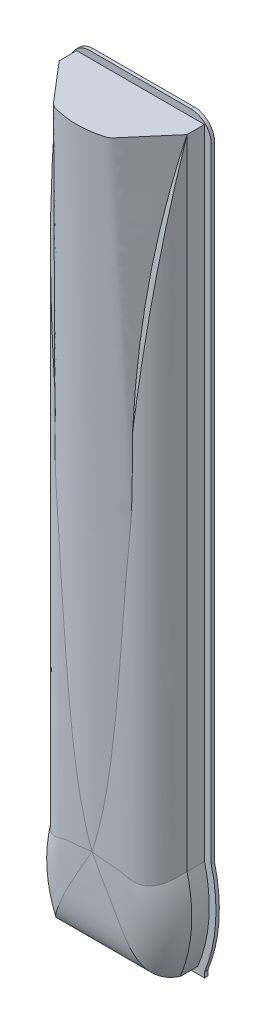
ISO-10303-21;
HEADER;
FILE_DESCRIPTION(('STEP AP214'),'2;1');
FILE_NAME('part.step','',(''),(''),'','','');
FILE_SCHEMA(('AUTOMOTIVE_DESIGN { 1 0 10303 214 1 1 1 1 }'));
ENDSEC;
DATA;
#1=APPLICATION_CONTEXT('core data for automotive mechanical design processes');
#2=APPLICATION_PROTOCOL_DEFINITION('international standard','automotive_design',2000,#1);
#3=PRODUCT_CONTEXT('',#1,'mechanical');
#4=PRODUCT('Part','Part','',(#3));
#5=PRODUCT_RELATED_PRODUCT_CATEGORY('part','',(#4));
#6=PRODUCT_DEFINITION_FORMATION('','',#4);
#7=PRODUCT_DEFINITION_CONTEXT('part definition',#1,'design');
#8=PRODUCT_DEFINITION('design','',#6,#7);
#9=PRODUCT_DEFINITION_SHAPE('','',#8);
#10=(LENGTH_UNIT() NAMED_UNIT(*) SI_UNIT(.MILLI.,.METRE.));
#11=(NAMED_UNIT(*) PLANE_ANGLE_UNIT() SI_UNIT($,.RADIAN.));
#12=(NAMED_UNIT(*) SI_UNIT($,.STERADIAN.) SOLID_ANGLE_UNIT());
#13=UNCERTAINTY_MEASURE_WITH_UNIT(LENGTH_MEASURE(1.E-05),#10,'distance_accuracy_value','');
#14=(GEOMETRIC_REPRESENTATION_CONTEXT(3) GLOBAL_UNCERTAINTY_ASSIGNED_CONTEXT((#13)) GLOBAL_UNIT_ASSIGNED_CONTEXT((#10,
#11,#12)) REPRESENTATION_CONTEXT('',''));
#15=CARTESIAN_POINT('',(0.,0.,0.));
#16=DIRECTION('',(0.,0.,1.));
#17=DIRECTION('',(1.,0.,0.));
#18=AXIS2_PLACEMENT_3D('',#15,#16,#17);
#19=CARTESIAN_POINT('',(9.50000005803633,109.346742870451,3.1));
#20=CARTESIAN_POINT('',(7.52568552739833,87.1542253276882,7.80994416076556));
#21=CARTESIAN_POINT('',(5.55137099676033,69.4789362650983,7.64348660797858));
#22=CARTESIAN_POINT('',(2.38470431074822,38.1872044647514,7.75706415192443));
#23=CARTESIAN_POINT('',(1.19235215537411,26.4048580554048,7.79982976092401));
#24=CARTESIAN_POINT('',(0.,14.6254314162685,7.71429854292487));
#25=CARTESIAN_POINT('',(7.91666671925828,109.34674287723,3.1));
#26=CARTESIAN_POINT('',(6.27140460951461,87.154225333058,7.80994416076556));
#27=CARTESIAN_POINT('',(4.62614249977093,69.4789362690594,7.64348660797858));
#28=CARTESIAN_POINT('',(1.9872535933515,38.1872044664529,7.75706415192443));
#29=CARTESIAN_POINT('',(0.993626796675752,26.4048580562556,7.79982976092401));
#30=CARTESIAN_POINT('',(0.,14.6254314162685,7.71429854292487));
#31=CARTESIAN_POINT('',(4.75000004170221,109.346742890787,3.1));
#32=CARTESIAN_POINT('',(3.76284277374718,87.1542253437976,7.80994416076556));
#33=CARTESIAN_POINT('',(2.77568550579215,69.4789362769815,7.64348660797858));
#34=CARTESIAN_POINT('',(1.19235215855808,38.1872044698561,7.75706415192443));
#35=CARTESIAN_POINT('',(0.596176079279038,26.4048580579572,7.79982976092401));
#36=CARTESIAN_POINT('',(0.,14.6254314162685,7.71429854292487));
#37=CARTESIAN_POINT('',(2.53680943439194E-08,109.346742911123,3.1));
#38=CARTESIAN_POINT('',(2.009603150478E-08,87.1542253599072,7.80994416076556));
#39=CARTESIAN_POINT('',(1.48239686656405E-08,69.4789362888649,7.64348660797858));
#40=CARTESIAN_POINT('',(6.36793721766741E-09,38.1872044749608,7.75706415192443));
#41=CARTESIAN_POINT('',(3.18396860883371E-09,26.4048580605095,7.79982976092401));
#42=CARTESIAN_POINT('',(0.,14.6254314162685,7.71429854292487));
#43=CARTESIAN_POINT('',(-4.74999999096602,109.346742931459,3.1));
#44=CARTESIAN_POINT('',(-3.76284273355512,87.1542253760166,7.80994416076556));
#45=CARTESIAN_POINT('',(-2.77568547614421,69.4789363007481,7.64348660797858));
#46=CARTESIAN_POINT('',(-1.1923521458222,38.1872044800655,7.75706415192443));
#47=CARTESIAN_POINT('',(-0.596176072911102,26.4048580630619,7.79982976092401));
#48=CARTESIAN_POINT('',(0.,14.6254314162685,7.71429854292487));
#49=CARTESIAN_POINT('',(-7.91666666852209,109.346742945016,3.1));
#50=CARTESIAN_POINT('',(-6.27140456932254,87.1542253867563,7.80994416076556));
#51=CARTESIAN_POINT('',(-4.62614247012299,69.4789363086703,7.64348660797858));
#52=CARTESIAN_POINT('',(-1.98725358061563,38.1872044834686,7.75706415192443));
#53=CARTESIAN_POINT('',(-0.993626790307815,26.4048580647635,7.79982976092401));
#54=CARTESIAN_POINT('',(0.,14.6254314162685,7.71429854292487));
#55=CARTESIAN_POINT('',(-9.50000000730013,109.346742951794,3.1));
#56=CARTESIAN_POINT('',(-7.52568548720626,87.1542253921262,7.80994416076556));
#57=CARTESIAN_POINT('',(-5.55137096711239,69.4789363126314,7.64348660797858));
#58=CARTESIAN_POINT('',(-2.38470429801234,38.1872044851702,7.75706415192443));
#59=CARTESIAN_POINT('',(-1.19235214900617,26.4048580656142,7.79982976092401));
#60=CARTESIAN_POINT('',(0.,14.6254314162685,7.71429854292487));
#61=B_SPLINE_SURFACE_WITH_KNOTS('',3,3,((#19,#20,#21,#22,#23,#24),(#25,#26,#27,#28,#29,#30),
(#31,#32,#33,#34,#35,#36),(#37,#38,#39,#40,#41,#42),(#43,#44,#45,#46,#47,#48),(#49,#50,#51,#52,
#53,#54),(#55,#56,#57,#58,#59,#60)),.UNSPECIFIED.,.F.,.F.,.F.,(4,1,1,1,4),(4,2,4),
(0.429207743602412,0.447889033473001,0.46657032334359,0.485251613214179,0.503932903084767),(0.,
0.623467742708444,1.),.UNSPECIFIED.);
#62=CARTESIAN_POINT('',(-9.49621996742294,109.346742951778,3.1));
#63=CARTESIAN_POINT('',(-9.405482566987,108.846788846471,3.20610674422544));
#64=CARTESIAN_POINT('',(-9.31632418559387,108.346156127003,3.310367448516));
#65=CARTESIAN_POINT('',(-9.14121697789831,107.343586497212,3.51513654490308));
#66=CARTESIAN_POINT('',(-9.05526801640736,106.841649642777,3.61564509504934));
#67=CARTESIAN_POINT('',(-8.88660917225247,105.836397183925,3.8128753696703));
#68=CARTESIAN_POINT('',(-8.80389984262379,105.33308135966,3.90959644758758));
#69=CARTESIAN_POINT('',(-8.64177398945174,104.325175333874,4.0991889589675));
#70=CARTESIAN_POINT('',(-8.56235761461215,103.820585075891,4.19206021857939));
#71=CARTESIAN_POINT('',(-8.27652169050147,101.963255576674,4.52632497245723));
#72=CARTESIAN_POINT('',(-8.08037784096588,100.606729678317,4.75570505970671));
#73=CARTESIAN_POINT('',(-7.71247352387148,97.8857072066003,5.18595836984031));
#74=CARTESIAN_POINT('',(-7.5407162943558,96.5212095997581,5.38682780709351));
#75=CARTESIAN_POINT('',(-7.22171372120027,93.7854189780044,5.75990952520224));
#76=CARTESIAN_POINT('',(-7.07446883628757,92.4141258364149,5.93212126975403));
#77=CARTESIAN_POINT('',(-6.80407525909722,89.6653593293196,6.24837357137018));
#78=CARTESIAN_POINT('',(-6.68093653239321,88.2878836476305,6.39240247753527));
#79=CARTESIAN_POINT('',(-6.45793088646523,85.5285382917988,6.65325282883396));
#80=CARTESIAN_POINT('',(-6.35806331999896,84.146668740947,6.77007503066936));
#81=CARTESIAN_POINT('',(-6.18013503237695,81.3797203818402,6.97822464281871));
#82=CARTESIAN_POINT('',(-6.10207274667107,79.9946418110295,7.06955388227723));
#83=CARTESIAN_POINT('',(-6.00287402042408,77.9778686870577,7.18562374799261));
#84=CARTESIAN_POINT('',(-5.97390225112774,77.3470581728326,7.21952481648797));
#85=CARTESIAN_POINT('',(-5.91981528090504,76.0850718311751,7.28281815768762));
#86=CARTESIAN_POINT('',(-5.89469990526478,75.4538960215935,7.31221063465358));
#87=CARTESIAN_POINT('',(-5.84809969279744,74.1917512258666,7.36675102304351));
#88=CARTESIAN_POINT('',(-5.82661188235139,73.5607824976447,7.39190241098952));
#89=CARTESIAN_POINT('',(-5.78697300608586,72.298575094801,7.43830412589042));
#90=CARTESIAN_POINT('',(-5.76882205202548,71.667336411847,7.45955432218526));
#91=CARTESIAN_POINT('',(-5.75220590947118,71.0360052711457,7.47901013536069));
#92=B_SPLINE_CURVE_WITH_KNOTS('',3,(#62,#63,#64,#65,#66,#67,#68,#69,#70,#71,#72,#73,#74,#75,#76,
#77,#78,#79,#80,#81,#82,#83,#84,#85,#86,#87,#88,#89,#90,#91),.UNSPECIFIED.,.F.,.F.,(4,2,2,2,2,2,
2,2,2,2,2,2,2,2,4),(0.,1.55723970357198,3.11441373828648,4.67185244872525,6.22936141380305,
10.3978631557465,14.5669178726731,18.736050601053,22.9069032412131,27.0776398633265,
31.2480771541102,33.1452106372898,35.0422581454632,36.9377429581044,38.8332912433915),.UNSPECIFIED.);
#93=CARTESIAN_POINT('',(-9.49621996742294,109.346742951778,3.1));
#94=VERTEX_POINT('',#93);
#95=CARTESIAN_POINT('',(-5.75220590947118,71.0360052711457,7.47901013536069));
#96=VERTEX_POINT('',#95);
#97=EDGE_CURVE('E448',#94,#96,#92,.T.);
#98=DIRECTION('',(1.,-4.28120476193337E-09,0.));
#99=VECTOR('',#98,1.);
#100=CARTESIAN_POINT('',(9.50000005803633,109.346742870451,3.1));
#101=LINE('',#100,#99);
#102=CARTESIAN_POINT('',(-9.50000000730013,109.346742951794,3.1));
#103=VERTEX_POINT('',#102);
#104=EDGE_CURVE('E841',#94,#103,#101,.F.);
#105=CARTESIAN_POINT('',(-9.50000000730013,109.346742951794,3.1));
#106=CARTESIAN_POINT('',(-7.52568548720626,87.1542253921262,7.80994416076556));
#107=CARTESIAN_POINT('',(-5.55137096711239,69.4789363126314,7.64348660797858));
#108=CARTESIAN_POINT('',(-2.38470429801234,38.1872044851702,7.75706415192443));
#109=CARTESIAN_POINT('',(-1.19235214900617,26.4048580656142,7.79982976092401));
#110=CARTESIAN_POINT('',(0.,14.6254314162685,7.71429854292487));
#111=B_SPLINE_CURVE_WITH_KNOTS('',3,(#105,#106,#107,#108,#109,#110),.UNSPECIFIED.,.F.,.F.,(4,2,
4),(0.,0.623467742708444,1.),.UNSPECIFIED.);
#112=EDGE_CURVE('E520',#103,#96,#111,.T.);
#113=ORIENTED_EDGE('',*,*,#97,.F.);
#114=ORIENTED_EDGE('',*,*,#104,.T.);
#115=ORIENTED_EDGE('',*,*,#112,.T.);
#116=EDGE_LOOP('',(#113,#114,#115));
#117=FACE_BOUND('',#116,.T.);
#118=ADVANCED_FACE('F201',(#117),#61,.T.);
#119=CARTESIAN_POINT('',(-11.7976716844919,8.98505573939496,0.5));
#120=DIRECTION('',(0.,0.,1.));
#121=DIRECTION('',(1.,0.,0.));
#122=AXIS2_PLACEMENT_3D('',#119,#120,#121);
#123=PLANE('',#122);
#124=DIRECTION('',(1.,0.,0.));
#125=VECTOR('',#124,1.);
#126=CARTESIAN_POINT('',(-9.50000000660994,-0.500492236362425,0.5));
#127=LINE('',#126,#125);
#128=CARTESIAN_POINT('',(-9.50000000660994,-0.500492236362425,0.5));
#129=VERTEX_POINT('',#128);
#130=CARTESIAN_POINT('',(-2.50000000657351,-0.500492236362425,0.5));
#131=VERTEX_POINT('',#130);
#132=EDGE_CURVE('E656',#129,#131,#127,.T.);
#133=ORIENTED_EDGE('',*,*,#132,.T.);
#134=DIRECTION('',(0.,1.,0.));
#135=VECTOR('',#134,1.);
#136=CARTESIAN_POINT('',(-2.50000000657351,-0.500492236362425,0.5));
#137=LINE('',#136,#135);
#138=CARTESIAN_POINT('',(-2.50000000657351,-6.10438349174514E-10,0.5));
#139=VERTEX_POINT('',#138);
#140=EDGE_CURVE('E733',#131,#139,#137,.T.);
#141=ORIENTED_EDGE('',*,*,#140,.T.);
#142=DIRECTION('',(1.,0.,0.));
#143=VECTOR('',#142,1.);
#144=CARTESIAN_POINT('',(-2.50000000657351,-6.10438349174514E-10,0.5));
#145=LINE('',#144,#143);
#146=CARTESIAN_POINT('',(2.49999999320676,-6.10438349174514E-10,0.5));
#147=VERTEX_POINT('',#146);
#148=EDGE_CURVE('E735',#139,#147,#145,.T.);
#149=ORIENTED_EDGE('',*,*,#148,.T.);
#150=DIRECTION('',(0.,-1.,0.));
#151=VECTOR('',#150,1.);
#152=CARTESIAN_POINT('',(2.49999999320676,-6.10438349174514E-10,0.5));
#153=LINE('',#152,#151);
#154=CARTESIAN_POINT('',(2.49999999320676,-0.500492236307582,0.5));
#155=VERTEX_POINT('',#154);
#156=EDGE_CURVE('E737',#147,#155,#153,.T.);
#157=ORIENTED_EDGE('',*,*,#156,.T.);
#158=DIRECTION('',(1.,0.,0.));
#159=VECTOR('',#158,1.);
#160=CARTESIAN_POINT('',(2.49999999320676,-0.500492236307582,0.5));
#161=LINE('',#160,#159);
#162=CARTESIAN_POINT('',(9.49999999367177,-0.500492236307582,0.5));
#163=VERTEX_POINT('',#162);
#164=EDGE_CURVE('E739',#155,#163,#161,.T.);
#165=ORIENTED_EDGE('',*,*,#164,.T.);
#166=DIRECTION('',(0.,1.,0.));
#167=VECTOR('',#166,1.);
#168=CARTESIAN_POINT('',(9.49999999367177,-0.500492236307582,0.5));
#169=LINE('',#168,#167);
#170=CARTESIAN_POINT('',(9.49999999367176,0.301209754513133,0.5));
#171=VERTEX_POINT('',#170);
#172=EDGE_CURVE('E741',#163,#171,#169,.T.);
#173=ORIENTED_EDGE('',*,*,#172,.T.);
#174=CARTESIAN_POINT('',(-11.7976716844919,8.98505573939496,0.5));
#175=DIRECTION('',(0.,0.,1.));
#176=DIRECTION('',(1.,0.,0.));
#177=AXIS2_PLACEMENT_3D('',#174,#175,#176);
#178=CIRCLE('',#177,23.0000000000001);
#179=CARTESIAN_POINT('',(10.4999999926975,14.6254314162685,0.5));
#180=VERTEX_POINT('',#179);
#181=EDGE_CURVE('E743',#171,#180,#178,.T.);
#182=ORIENTED_EDGE('',*,*,#181,.T.);
#183=DIRECTION('',(0.,1.,0.));
#184=VECTOR('',#183,1.);
#185=CARTESIAN_POINT('',(10.4999999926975,14.6254314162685,0.5));
#186=LINE('',#185,#184);
#187=CARTESIAN_POINT('',(10.4999999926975,107.344773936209,0.5));
#188=VERTEX_POINT('',#187);
#189=EDGE_CURVE('E745',#180,#188,#186,.T.);
#190=ORIENTED_EDGE('',*,*,#189,.T.);
#191=CARTESIAN_POINT('',(10.4999999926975,107.344773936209,0.5));
#192=CARTESIAN_POINT('',(10.4997864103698,107.941944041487,0.5));
#193=CARTESIAN_POINT('',(10.2717787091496,108.49323926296,0.5));
#194=CARTESIAN_POINT('',(10.0440329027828,109.043901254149,0.5));
#195=CARTESIAN_POINT('',(9.62242700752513,109.46637867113,0.5));
#196=CARTESIAN_POINT('',(9.20168100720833,109.887994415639,0.5));
#197=CARTESIAN_POINT('',(8.65082789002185,110.117078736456,0.5));
#198=CARTESIAN_POINT('',(8.09910944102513,110.346522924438,0.5));
#199=CARTESIAN_POINT('',(7.49999999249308,110.346742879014,0.5));
#200=B_SPLINE_CURVE_WITH_KNOTS('',2,(#191,#192,#193,#194,#195,#196,#197,#198,#199),
.UNSPECIFIED.,.F.,.F.,(3,2,2,2,3),(0.,0.25,0.5,0.75,1.),.UNSPECIFIED.);
#201=CARTESIAN_POINT('',(7.49999999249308,110.346742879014,0.5));
#202=VERTEX_POINT('',#201);
#203=EDGE_CURVE('E746',#188,#202,#200,.T.);
#204=ORIENTED_EDGE('',*,*,#203,.T.);
#205=DIRECTION('',(-1.,0.,0.));
#206=VECTOR('',#205,1.);
#207=CARTESIAN_POINT('',(7.49999999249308,110.346742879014,0.5));
#208=LINE('',#207,#206);
#209=CARTESIAN_POINT('',(-7.50000000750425,110.346742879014,0.5));
#210=VERTEX_POINT('',#209);
#211=EDGE_CURVE('E605',#202,#210,#208,.T.);
#212=ORIENTED_EDGE('',*,*,#211,.T.);
#213=CARTESIAN_POINT('',(-7.50000000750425,110.346742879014,0.5));
#214=CARTESIAN_POINT('',(-8.09714248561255,110.346528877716,0.5));
#215=CARTESIAN_POINT('',(-8.64835890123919,110.118103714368,0.5));
#216=CARTESIAN_POINT('',(-9.19874364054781,109.890023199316,0.5));
#217=CARTESIAN_POINT('',(-9.62091052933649,109.467896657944,0.5));
#218=CARTESIAN_POINT('',(-10.0420060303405,109.046841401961,0.5));
#219=CARTESIAN_POINT('',(-10.2707543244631,108.495711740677,0.5));
#220=CARTESIAN_POINT('',(-10.4997804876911,107.943912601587,0.5));
#221=CARTESIAN_POINT('',(-10.5000000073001,107.344773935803,0.5));
#222=B_SPLINE_CURVE_WITH_KNOTS('',2,(#213,#214,#215,#216,#217,#218,#219,#220,#221),
.UNSPECIFIED.,.F.,.F.,(3,2,2,2,3),(0.,0.25,0.5,0.75,1.),.UNSPECIFIED.);
#223=CARTESIAN_POINT('',(-10.5000000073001,107.344773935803,0.5));
#224=VERTEX_POINT('',#223);
#225=EDGE_CURVE('E598',#210,#224,#222,.T.);
#226=ORIENTED_EDGE('',*,*,#225,.T.);
#227=DIRECTION('',(0.,-1.,0.));
#228=VECTOR('',#227,1.);
#229=CARTESIAN_POINT('',(-10.5000000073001,107.344773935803,0.5));
#230=LINE('',#229,#228);
#231=CARTESIAN_POINT('',(-10.5000000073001,14.6254314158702,0.5));
#232=VERTEX_POINT('',#231);
#233=EDGE_CURVE('E604',#224,#232,#230,.T.);
#234=ORIENTED_EDGE('',*,*,#233,.T.);
#235=CARTESIAN_POINT('',(11.7976716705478,8.98505574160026,0.5));
#236=DIRECTION('',(0.,0.,1.));
#237=DIRECTION('',(1.,0.,0.));
#238=AXIS2_PLACEMENT_3D('',#235,#236,#237);
#239=CIRCLE('',#238,23.);
#240=CARTESIAN_POINT('',(-9.50000000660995,0.30120975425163,0.5));
#241=VERTEX_POINT('',#240);
#242=EDGE_CURVE('E611',#232,#241,#239,.T.);
#243=ORIENTED_EDGE('',*,*,#242,.T.);
#244=DIRECTION('',(0.,-1.,0.));
#245=VECTOR('',#244,1.);
#246=CARTESIAN_POINT('',(-9.50000000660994,0.301209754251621,0.5));
#247=LINE('',#246,#245);
#248=EDGE_CURVE('E613',#241,#129,#247,.T.);
#249=ORIENTED_EDGE('',*,*,#248,.T.);
#250=EDGE_LOOP('',(#133,#141,#149,#157,#165,#173,#182,#190,#204,#212,#226,#234,#243,#249));
#251=FACE_BOUND('',#250,.T.);
#252=CARTESIAN_POINT('',(11.7976716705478,8.98505574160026,0.5));
#253=DIRECTION('',(0.,0.,1.));
#254=DIRECTION('',(1.,0.,0.));
#255=AXIS2_PLACEMENT_3D('',#252,#253,#254);
#256=CIRCLE('',#255,22.);
#257=CARTESIAN_POINT('',(-9.50000000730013,14.4995077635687,0.5));
#258=VERTEX_POINT('',#257);
#259=CARTESIAN_POINT('',(-8.50000000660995,0.499507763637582,0.5));
#260=VERTEX_POINT('',#259);
#261=EDGE_CURVE('E829',#258,#260,#256,.T.);
#262=ORIENTED_EDGE('',*,*,#261,.F.);
#263=DIRECTION('',(0.,-1.,0.));
#264=VECTOR('',#263,1.);
#265=CARTESIAN_POINT('',(-9.50000000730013,109.346742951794,0.5));
#266=LINE('',#265,#264);
#267=CARTESIAN_POINT('',(-9.50000000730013,109.346742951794,0.5));
#268=VERTEX_POINT('',#267);
#269=EDGE_CURVE('E726',#268,#258,#266,.T.);
#270=ORIENTED_EDGE('',*,*,#269,.F.);
#271=DIRECTION('',(-1.,4.28120476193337E-09,0.));
#272=VECTOR('',#271,1.);
#273=CARTESIAN_POINT('',(9.50000005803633,109.346742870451,0.5));
#274=LINE('',#273,#272);
#275=CARTESIAN_POINT('',(9.50000005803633,109.346742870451,0.5));
#276=VERTEX_POINT('',#275);
#277=EDGE_CURVE('E714',#276,#268,#274,.T.);
#278=ORIENTED_EDGE('',*,*,#277,.F.);
#279=DIRECTION('',(6.88884424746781E-10,1.,0.));
#280=VECTOR('',#279,1.);
#281=CARTESIAN_POINT('',(9.49999999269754,14.4995077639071,0.5));
#282=LINE('',#281,#280);
#283=CARTESIAN_POINT('',(9.49999999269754,14.4995077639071,0.5));
#284=VERTEX_POINT('',#283);
#285=EDGE_CURVE('E717',#284,#276,#282,.T.);
#286=ORIENTED_EDGE('',*,*,#285,.F.);
#287=CARTESIAN_POINT('',(-11.7976716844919,8.98505573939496,0.5));
#288=DIRECTION('',(0.,0.,1.));
#289=DIRECTION('',(1.,0.,0.));
#290=AXIS2_PLACEMENT_3D('',#287,#288,#289);
#291=CIRCLE('',#290,22.0000000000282);
#292=CARTESIAN_POINT('',(8.49999999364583,0.499507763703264,0.5));
#293=VERTEX_POINT('',#292);
#294=EDGE_CURVE('E721',#293,#284,#291,.T.);
#295=ORIENTED_EDGE('',*,*,#294,.F.);
#296=DIRECTION('',(1.,3.22567365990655E-12,0.));
#297=VECTOR('',#296,1.);
#298=CARTESIAN_POINT('',(-8.50000000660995,0.499507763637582,0.5));
#299=LINE('',#298,#297);
#300=EDGE_CURVE('E831',#260,#293,#299,.T.);
#301=ORIENTED_EDGE('',*,*,#300,.F.);
#302=EDGE_LOOP('',(#262,#270,#278,#286,#295,#301));
#303=FACE_BOUND('',#302,.T.);
#304=ADVANCED_FACE('F572',(#251,#303),#123,.T.);
#305=CARTESIAN_POINT('',(-9.50000000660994,-0.500492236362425,0.5));
#306=DIRECTION('',(0.,1.,0.));
#307=DIRECTION('',(0.,0.,1.));
#308=AXIS2_PLACEMENT_3D('',#305,#306,#307);
#309=PLANE('',#308);
#310=DIRECTION('',(1.,0.,0.));
#311=VECTOR('',#310,1.);
#312=CARTESIAN_POINT('',(-9.50000000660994,-0.500492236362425,0.));
#313=LINE('',#312,#311);
#314=CARTESIAN_POINT('',(-9.50000000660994,-0.500492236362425,0.));
#315=VERTEX_POINT('',#314);
#316=CARTESIAN_POINT('',(-2.50000000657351,-0.500492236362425,0.));
#317=VERTEX_POINT('',#316);
#318=EDGE_CURVE('E616',#315,#317,#313,.T.);
#319=ORIENTED_EDGE('',*,*,#318,.T.);
#320=DIRECTION('',(0.,0.,-1.));
#321=VECTOR('',#320,1.);
#322=CARTESIAN_POINT('',(-2.50000000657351,-0.500492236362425,0.5));
#323=LINE('',#322,#321);
#324=EDGE_CURVE('E213',#131,#317,#323,.T.);
#325=ORIENTED_EDGE('',*,*,#324,.F.);
#326=ORIENTED_EDGE('',*,*,#132,.F.);
#327=DIRECTION('',(0.,0.,-1.));
#328=VECTOR('',#327,1.);
#329=CARTESIAN_POINT('',(-9.50000000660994,-0.500492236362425,0.5));
#330=LINE('',#329,#328);
#331=EDGE_CURVE('E615',#129,#315,#330,.T.);
#332=ORIENTED_EDGE('',*,*,#331,.T.);
#333=EDGE_LOOP('',(#319,#325,#326,#332));
#334=FACE_BOUND('',#333,.T.);
#335=ADVANCED_FACE('F203',(#334),#309,.F.);
#336=CARTESIAN_POINT('',(-2.50000000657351,-0.500492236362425,0.5));
#337=DIRECTION('',(-1.,0.,0.));
#338=DIRECTION('',(0.,-1.,0.));
#339=AXIS2_PLACEMENT_3D('',#336,#337,#338);
#340=PLANE('',#339);
#341=DIRECTION('',(0.,1.,0.));
#342=VECTOR('',#341,1.);
#343=CARTESIAN_POINT('',(-2.50000000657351,-0.500492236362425,0.));
#344=LINE('',#343,#342);
#345=CARTESIAN_POINT('',(-2.50000000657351,-6.10438349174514E-10,0.));
#346=VERTEX_POINT('',#345);
#347=EDGE_CURVE('E619',#317,#346,#344,.T.);
#348=ORIENTED_EDGE('',*,*,#347,.T.);
#349=DIRECTION('',(0.,0.,-1.));
#350=VECTOR('',#349,1.);
#351=CARTESIAN_POINT('',(-2.50000000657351,-6.10438349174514E-10,0.5));
#352=LINE('',#351,#350);
#353=EDGE_CURVE('E692',#139,#346,#352,.T.);
#354=ORIENTED_EDGE('',*,*,#353,.F.);
#355=ORIENTED_EDGE('',*,*,#140,.F.);
#356=ORIENTED_EDGE('',*,*,#324,.T.);
#357=EDGE_LOOP('',(#348,#354,#355,#356));
#358=FACE_BOUND('',#357,.T.);
#359=ADVANCED_FACE('F779',(#358),#340,.F.);
#360=CARTESIAN_POINT('',(-2.50000000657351,-6.10438349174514E-10,0.5));
#361=DIRECTION('',(0.,1.,0.));
#362=DIRECTION('',(0.,0.,1.));
#363=AXIS2_PLACEMENT_3D('',#360,#361,#362);
#364=PLANE('',#363);
#365=DIRECTION('',(1.,0.,0.));
#366=VECTOR('',#365,1.);
#367=CARTESIAN_POINT('',(-2.50000000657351,-6.10438349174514E-10,0.));
#368=LINE('',#367,#366);
#369=CARTESIAN_POINT('',(2.49999999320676,-6.10438349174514E-10,0.));
#370=VERTEX_POINT('',#369);
#371=EDGE_CURVE('E622',#346,#370,#368,.T.);
#372=ORIENTED_EDGE('',*,*,#371,.T.);
#373=DIRECTION('',(0.,0.,-1.));
#374=VECTOR('',#373,1.);
#375=CARTESIAN_POINT('',(2.49999999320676,-6.10438349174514E-10,0.5));
#376=LINE('',#375,#374);
#377=EDGE_CURVE('E689',#147,#370,#376,.T.);
#378=ORIENTED_EDGE('',*,*,#377,.F.);
#379=ORIENTED_EDGE('',*,*,#148,.F.);
#380=ORIENTED_EDGE('',*,*,#353,.T.);
#381=EDGE_LOOP('',(#372,#378,#379,#380));
#382=FACE_BOUND('',#381,.T.);
#383=ADVANCED_FACE('F776',(#382),#364,.F.);
#384=CARTESIAN_POINT('',(2.49999999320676,-6.10438349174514E-10,0.5));
#385=DIRECTION('',(1.,0.,0.));
#386=DIRECTION('',(0.,0.,-1.));
#387=AXIS2_PLACEMENT_3D('',#384,#385,#386);
#388=PLANE('',#387);
#389=DIRECTION('',(0.,-1.,0.));
#390=VECTOR('',#389,1.);
#391=CARTESIAN_POINT('',(2.49999999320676,-6.10438349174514E-10,0.));
#392=LINE('',#391,#390);
#393=CARTESIAN_POINT('',(2.49999999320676,-0.500492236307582,0.));
#394=VERTEX_POINT('',#393);
#395=EDGE_CURVE('E624',#370,#394,#392,.T.);
#396=ORIENTED_EDGE('',*,*,#395,.T.);
#397=DIRECTION('',(0.,0.,-1.));
#398=VECTOR('',#397,1.);
#399=CARTESIAN_POINT('',(2.49999999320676,-0.500492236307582,0.5));
#400=LINE('',#399,#398);
#401=EDGE_CURVE('E686',#155,#394,#400,.T.);
#402=ORIENTED_EDGE('',*,*,#401,.F.);
#403=ORIENTED_EDGE('',*,*,#156,.F.);
#404=ORIENTED_EDGE('',*,*,#377,.T.);
#405=EDGE_LOOP('',(#396,#402,#403,#404));
#406=FACE_BOUND('',#405,.T.);
#407=ADVANCED_FACE('F772',(#406),#388,.F.);
#408=CARTESIAN_POINT('',(2.49999999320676,-0.500492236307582,0.5));
#409=DIRECTION('',(0.,1.,0.));
#410=DIRECTION('',(0.,0.,1.));
#411=AXIS2_PLACEMENT_3D('',#408,#409,#410);
#412=PLANE('',#411);
#413=DIRECTION('',(1.,0.,0.));
#414=VECTOR('',#413,1.);
#415=CARTESIAN_POINT('',(2.49999999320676,-0.500492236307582,0.));
#416=LINE('',#415,#414);
#417=CARTESIAN_POINT('',(9.49999999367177,-0.500492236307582,0.));
#418=VERTEX_POINT('',#417);
#419=EDGE_CURVE('E626',#394,#418,#416,.T.);
#420=ORIENTED_EDGE('',*,*,#419,.T.);
#421=DIRECTION('',(0.,0.,-1.));
#422=VECTOR('',#421,1.);
#423=CARTESIAN_POINT('',(9.49999999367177,-0.500492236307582,0.5));
#424=LINE('',#423,#422);
#425=EDGE_CURVE('E683',#163,#418,#424,.T.);
#426=ORIENTED_EDGE('',*,*,#425,.F.);
#427=ORIENTED_EDGE('',*,*,#164,.F.);
#428=ORIENTED_EDGE('',*,*,#401,.T.);
#429=EDGE_LOOP('',(#420,#426,#427,#428));
#430=FACE_BOUND('',#429,.T.);
#431=ADVANCED_FACE('F768',(#430),#412,.F.);
#432=CARTESIAN_POINT('',(9.49999999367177,-0.500492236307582,0.5));
#433=DIRECTION('',(-1.,0.,0.));
#434=DIRECTION('',(0.,-1.,0.));
#435=AXIS2_PLACEMENT_3D('',#432,#433,#434);
#436=PLANE('',#435);
#437=DIRECTION('',(0.,1.,0.));
#438=VECTOR('',#437,1.);
#439=CARTESIAN_POINT('',(9.49999999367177,-0.500492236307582,0.));
#440=LINE('',#439,#438);
#441=CARTESIAN_POINT('',(9.49999999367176,0.301209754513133,0.));
#442=VERTEX_POINT('',#441);
#443=EDGE_CURVE('E628',#418,#442,#440,.T.);
#444=ORIENTED_EDGE('',*,*,#443,.T.);
#445=DIRECTION('',(0.,0.,-1.));
#446=VECTOR('',#445,1.);
#447=CARTESIAN_POINT('',(9.49999999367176,0.301209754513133,0.5));
#448=LINE('',#447,#446);
#449=EDGE_CURVE('E680',#171,#442,#448,.T.);
#450=ORIENTED_EDGE('',*,*,#449,.F.);
#451=ORIENTED_EDGE('',*,*,#172,.F.);
#452=ORIENTED_EDGE('',*,*,#425,.T.);
#453=EDGE_LOOP('',(#444,#450,#451,#452));
#454=FACE_BOUND('',#453,.T.);
#455=ADVANCED_FACE('F764',(#454),#436,.F.);
#456=CARTESIAN_POINT('',(-11.7976716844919,8.98505573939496,0.5));
#457=DIRECTION('',(0.,0.,-1.));
#458=DIRECTION('',(-1.,0.,0.));
#459=AXIS2_PLACEMENT_3D('',#456,#457,#458);
#460=CYLINDRICAL_SURFACE('',#459,23.0000000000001);
#461=CARTESIAN_POINT('',(-11.7976716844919,8.98505573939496,0.));
#462=DIRECTION('',(0.,0.,1.));
#463=DIRECTION('',(1.,0.,0.));
#464=AXIS2_PLACEMENT_3D('',#461,#462,#463);
#465=CIRCLE('',#464,23.0000000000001);
#466=CARTESIAN_POINT('',(10.4999999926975,14.6254314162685,0.));
#467=VERTEX_POINT('',#466);
#468=EDGE_CURVE('E630',#442,#467,#465,.T.);
#469=ORIENTED_EDGE('',*,*,#468,.T.);
#470=DIRECTION('',(0.,0.,-1.));
#471=VECTOR('',#470,1.);
#472=CARTESIAN_POINT('',(10.4999999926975,14.6254314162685,0.5));
#473=LINE('',#472,#471);
#474=EDGE_CURVE('E677',#180,#467,#473,.T.);
#475=ORIENTED_EDGE('',*,*,#474,.F.);
#476=ORIENTED_EDGE('',*,*,#181,.F.);
#477=ORIENTED_EDGE('',*,*,#449,.T.);
#478=EDGE_LOOP('',(#469,#475,#476,#477));
#479=FACE_BOUND('',#478,.T.);
#480=ADVANCED_FACE('F760',(#479),#460,.T.);
#481=CARTESIAN_POINT('',(10.4999999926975,14.6254314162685,0.5));
#482=DIRECTION('',(-1.,0.,0.));
#483=DIRECTION('',(0.,-1.,0.));
#484=AXIS2_PLACEMENT_3D('',#481,#482,#483);
#485=PLANE('',#484);
#486=DIRECTION('',(0.,1.,0.));
#487=VECTOR('',#486,1.);
#488=CARTESIAN_POINT('',(10.4999999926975,14.6254314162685,0.));
#489=LINE('',#488,#487);
#490=CARTESIAN_POINT('',(10.4999999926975,107.344773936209,0.));
#491=VERTEX_POINT('',#490);
#492=EDGE_CURVE('E632',#467,#491,#489,.T.);
#493=ORIENTED_EDGE('',*,*,#492,.T.);
#494=DIRECTION('',(0.,0.,-1.));
#495=VECTOR('',#494,1.);
#496=CARTESIAN_POINT('',(10.4999999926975,107.344773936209,0.5));
#497=LINE('',#496,#495);
#498=EDGE_CURVE('E674',#188,#491,#497,.T.);
#499=ORIENTED_EDGE('',*,*,#498,.F.);
#500=ORIENTED_EDGE('',*,*,#189,.F.);
#501=ORIENTED_EDGE('',*,*,#474,.T.);
#502=EDGE_LOOP('',(#493,#499,#500,#501));
#503=FACE_BOUND('',#502,.T.);
#504=ADVANCED_FACE('F756',(#503),#485,.F.);
#505=DIRECTION('',(0.,0.,-1.));
#506=VECTOR('',#505,1.);
#507=SURFACE_OF_LINEAR_EXTRUSION('',#200,#506);
#508=CARTESIAN_POINT('',(10.4999999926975,107.344773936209,0.));
#509=CARTESIAN_POINT('',(10.4997864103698,107.941944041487,0.));
#510=CARTESIAN_POINT('',(10.2717787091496,108.49323926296,0.));
#511=CARTESIAN_POINT('',(10.0440329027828,109.043901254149,0.));
#512=CARTESIAN_POINT('',(9.62242700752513,109.46637867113,0.));
#513=CARTESIAN_POINT('',(9.20168100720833,109.887994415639,0.));
#514=CARTESIAN_POINT('',(8.65082789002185,110.117078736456,0.));
#515=CARTESIAN_POINT('',(8.09910944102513,110.346522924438,0.));
#516=CARTESIAN_POINT('',(7.49999999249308,110.346742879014,0.));
#517=B_SPLINE_CURVE_WITH_KNOTS('',2,(#508,#509,#510,#511,#512,#513,#514,#515,#516),
.UNSPECIFIED.,.F.,.F.,(3,2,2,2,3),(0.,0.25,0.5,0.75,1.),.UNSPECIFIED.);
#518=CARTESIAN_POINT('',(7.49999999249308,110.346742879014,0.));
#519=VERTEX_POINT('',#518);
#520=EDGE_CURVE('E634',#491,#519,#517,.T.);
#521=ORIENTED_EDGE('',*,*,#520,.T.);
#522=DIRECTION('',(0.,0.,-1.));
#523=VECTOR('',#522,1.);
#524=CARTESIAN_POINT('',(7.49999999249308,110.346742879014,0.5));
#525=LINE('',#524,#523);
#526=EDGE_CURVE('E671',#202,#519,#525,.T.);
#527=ORIENTED_EDGE('',*,*,#526,.F.);
#528=ORIENTED_EDGE('',*,*,#203,.F.);
#529=ORIENTED_EDGE('',*,*,#498,.T.);
#530=EDGE_LOOP('',(#521,#527,#528,#529));
#531=FACE_BOUND('',#530,.T.);
#532=ADVANCED_FACE('F753',(#531),#507,.F.);
#533=CARTESIAN_POINT('',(7.49999999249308,110.346742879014,0.5));
#534=DIRECTION('',(0.,-1.,0.));
#535=DIRECTION('',(0.,0.,-1.));
#536=AXIS2_PLACEMENT_3D('',#533,#534,#535);
#537=PLANE('',#536);
#538=DIRECTION('',(-1.,0.,0.));
#539=VECTOR('',#538,1.);
#540=CARTESIAN_POINT('',(7.49999999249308,110.346742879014,0.));
#541=LINE('',#540,#539);
#542=CARTESIAN_POINT('',(-7.50000000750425,110.346742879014,0.));
#543=VERTEX_POINT('',#542);
#544=EDGE_CURVE('E638',#519,#543,#541,.T.);
#545=ORIENTED_EDGE('',*,*,#544,.T.);
#546=DIRECTION('',(0.,0.,-1.));
#547=VECTOR('',#546,1.);
#548=CARTESIAN_POINT('',(-7.50000000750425,110.346742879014,0.5));
#549=LINE('',#548,#547);
#550=EDGE_CURVE('E668',#210,#543,#549,.T.);
#551=ORIENTED_EDGE('',*,*,#550,.F.);
#552=ORIENTED_EDGE('',*,*,#211,.F.);
#553=ORIENTED_EDGE('',*,*,#526,.T.);
#554=EDGE_LOOP('',(#545,#551,#552,#553));
#555=FACE_BOUND('',#554,.T.);
#556=ADVANCED_FACE('F595',(#555),#537,.F.);
#557=DIRECTION('',(0.,0.,-1.));
#558=VECTOR('',#557,1.);
#559=SURFACE_OF_LINEAR_EXTRUSION('',#222,#558);
#560=CARTESIAN_POINT('',(-7.50000000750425,110.346742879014,0.));
#561=CARTESIAN_POINT('',(-8.09714248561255,110.346528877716,0.));
#562=CARTESIAN_POINT('',(-8.64835890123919,110.118103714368,0.));
#563=CARTESIAN_POINT('',(-9.19874364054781,109.890023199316,0.));
#564=CARTESIAN_POINT('',(-9.62091052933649,109.467896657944,0.));
#565=CARTESIAN_POINT('',(-10.0420060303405,109.046841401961,0.));
#566=CARTESIAN_POINT('',(-10.2707543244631,108.495711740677,0.));
#567=CARTESIAN_POINT('',(-10.4997804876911,107.943912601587,0.));
#568=CARTESIAN_POINT('',(-10.5000000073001,107.344773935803,0.));
#569=B_SPLINE_CURVE_WITH_KNOTS('',2,(#560,#561,#562,#563,#564,#565,#566,#567,#568),
.UNSPECIFIED.,.F.,.F.,(3,2,2,2,3),(0.,0.25,0.5,0.75,1.),.UNSPECIFIED.);
#570=CARTESIAN_POINT('',(-10.5000000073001,107.344773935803,0.));
#571=VERTEX_POINT('',#570);
#572=EDGE_CURVE('E643',#543,#571,#569,.T.);
#573=ORIENTED_EDGE('',*,*,#572,.T.);
#574=DIRECTION('',(0.,0.,-1.));
#575=VECTOR('',#574,1.);
#576=CARTESIAN_POINT('',(-10.5000000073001,107.344773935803,0.5));
#577=LINE('',#576,#575);
#578=EDGE_CURVE('E665',#224,#571,#577,.T.);
#579=ORIENTED_EDGE('',*,*,#578,.F.);
#580=ORIENTED_EDGE('',*,*,#225,.F.);
#581=ORIENTED_EDGE('',*,*,#550,.T.);
#582=EDGE_LOOP('',(#573,#579,#580,#581));
#583=FACE_BOUND('',#582,.T.);
#584=ADVANCED_FACE('F590',(#583),#559,.F.);
#585=CARTESIAN_POINT('',(-10.5000000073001,107.344773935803,0.5));
#586=DIRECTION('',(1.,0.,0.));
#587=DIRECTION('',(0.,1.,0.));
#588=AXIS2_PLACEMENT_3D('',#585,#586,#587);
#589=PLANE('',#588);
#590=DIRECTION('',(0.,-1.,0.));
#591=VECTOR('',#590,1.);
#592=CARTESIAN_POINT('',(-10.5000000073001,107.344773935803,0.));
#593=LINE('',#592,#591);
#594=CARTESIAN_POINT('',(-10.5000000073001,14.6254314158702,0.));
#595=VERTEX_POINT('',#594);
#596=EDGE_CURVE('E647',#571,#595,#593,.T.);
#597=ORIENTED_EDGE('',*,*,#596,.T.);
#598=DIRECTION('',(0.,0.,-1.));
#599=VECTOR('',#598,1.);
#600=CARTESIAN_POINT('',(-10.5000000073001,14.6254314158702,0.5));
#601=LINE('',#600,#599);
#602=EDGE_CURVE('E662',#232,#595,#601,.T.);
#603=ORIENTED_EDGE('',*,*,#602,.F.);
#604=ORIENTED_EDGE('',*,*,#233,.F.);
#605=ORIENTED_EDGE('',*,*,#578,.T.);
#606=EDGE_LOOP('',(#597,#603,#604,#605));
#607=FACE_BOUND('',#606,.T.);
#608=ADVANCED_FACE('F586',(#607),#589,.F.);
#609=CARTESIAN_POINT('',(11.7976716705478,8.98505574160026,0.5));
#610=DIRECTION('',(0.,0.,-1.));
#611=DIRECTION('',(-1.,0.,0.));
#612=AXIS2_PLACEMENT_3D('',#609,#610,#611);
#613=CYLINDRICAL_SURFACE('',#612,23.);
#614=CARTESIAN_POINT('',(11.7976716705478,8.98505574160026,0.));
#615=DIRECTION('',(0.,0.,1.));
#616=DIRECTION('',(1.,0.,0.));
#617=AXIS2_PLACEMENT_3D('',#614,#615,#616);
#618=CIRCLE('',#617,23.);
#619=CARTESIAN_POINT('',(-9.50000000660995,0.30120975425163,0.));
#620=VERTEX_POINT('',#619);
#621=EDGE_CURVE('E652',#595,#620,#618,.T.);
#622=ORIENTED_EDGE('',*,*,#621,.T.);
#623=DIRECTION('',(0.,0.,-1.));
#624=VECTOR('',#623,1.);
#625=CARTESIAN_POINT('',(-9.50000000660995,0.30120975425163,0.5));
#626=LINE('',#625,#624);
#627=EDGE_CURVE('E659',#241,#620,#626,.T.);
#628=ORIENTED_EDGE('',*,*,#627,.F.);
#629=ORIENTED_EDGE('',*,*,#242,.F.);
#630=ORIENTED_EDGE('',*,*,#602,.T.);
#631=EDGE_LOOP('',(#622,#628,#629,#630));
#632=FACE_BOUND('',#631,.T.);
#633=ADVANCED_FACE('F582',(#632),#613,.T.);
#634=CARTESIAN_POINT('',(-9.50000000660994,0.301209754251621,0.5));
#635=DIRECTION('',(1.,0.,0.));
#636=DIRECTION('',(0.,0.,-1.));
#637=AXIS2_PLACEMENT_3D('',#634,#635,#636);
#638=PLANE('',#637);
#639=DIRECTION('',(0.,-1.,0.));
#640=VECTOR('',#639,1.);
#641=CARTESIAN_POINT('',(-9.50000000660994,0.301209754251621,0.));
#642=LINE('',#641,#640);
#643=EDGE_CURVE('E654',#620,#315,#642,.T.);
#644=ORIENTED_EDGE('',*,*,#643,.T.);
#645=ORIENTED_EDGE('',*,*,#331,.F.);
#646=ORIENTED_EDGE('',*,*,#248,.F.);
#647=ORIENTED_EDGE('',*,*,#627,.T.);
#648=EDGE_LOOP('',(#644,#645,#646,#647));
#649=FACE_BOUND('',#648,.T.);
#650=ADVANCED_FACE('F578',(#649),#638,.F.);
#651=CARTESIAN_POINT('',(-11.7976716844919,8.98505573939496,0.));
#652=DIRECTION('',(0.,0.,1.));
#653=DIRECTION('',(1.,0.,0.));
#654=AXIS2_PLACEMENT_3D('',#651,#652,#653);
#655=PLANE('',#654);
#656=ORIENTED_EDGE('',*,*,#318,.F.);
#657=ORIENTED_EDGE('',*,*,#643,.F.);
#658=ORIENTED_EDGE('',*,*,#621,.F.);
#659=ORIENTED_EDGE('',*,*,#596,.F.);
#660=ORIENTED_EDGE('',*,*,#572,.F.);
#661=ORIENTED_EDGE('',*,*,#544,.F.);
#662=ORIENTED_EDGE('',*,*,#520,.F.);
#663=ORIENTED_EDGE('',*,*,#492,.F.);
#664=ORIENTED_EDGE('',*,*,#468,.F.);
#665=ORIENTED_EDGE('',*,*,#443,.F.);
#666=ORIENTED_EDGE('',*,*,#419,.F.);
#667=ORIENTED_EDGE('',*,*,#395,.F.);
#668=ORIENTED_EDGE('',*,*,#371,.F.);
#669=ORIENTED_EDGE('',*,*,#347,.F.);
#670=EDGE_LOOP('',(#656,#657,#658,#659,#660,#661,#662,#663,#664,#665,#666,#667,#668,#669));
#671=FACE_BOUND('',#670,.T.);
#672=ADVANCED_FACE('F571',(#671),#655,.F.);
#673=CARTESIAN_POINT('',(-9.50000000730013,109.346742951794,3.1));
#674=DIRECTION('',(1.,0.,0.));
#675=DIRECTION('',(0.,1.,0.));
#676=AXIS2_PLACEMENT_3D('',#673,#674,#675);
#677=PLANE('',#676);
#678=ORIENTED_EDGE('',*,*,#269,.T.);
#679=DIRECTION('',(0.,0.,-1.));
#680=VECTOR('',#679,1.);
#681=CARTESIAN_POINT('',(-9.50000000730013,14.4995077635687,3.1));
#682=LINE('',#681,#680);
#683=CARTESIAN_POINT('',(-9.50000000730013,14.4995077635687,3.1));
#684=VERTEX_POINT('',#683);
#685=EDGE_CURVE('E620',#684,#258,#682,.T.);
#686=ORIENTED_EDGE('',*,*,#685,.F.);
#687=DIRECTION('',(0.,1.,0.));
#688=VECTOR('',#687,1.);
#689=CARTESIAN_POINT('',(-9.50000000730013,109.346742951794,3.1));
#690=LINE('',#689,#688);
#691=CARTESIAN_POINT('',(-9.50000000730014,14.6254314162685,3.1));
#692=VERTEX_POINT('',#691);
#693=EDGE_CURVE('E221',#692,#684,#690,.F.);
#694=ORIENTED_EDGE('',*,*,#693,.F.);
#695=EDGE_CURVE('E556',#103,#692,#690,.F.);
#696=ORIENTED_EDGE('',*,*,#695,.F.);
#697=DIRECTION('',(0.,0.,-1.));
#698=VECTOR('',#697,1.);
#699=CARTESIAN_POINT('',(-9.50000000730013,109.346742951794,3.1));
#700=LINE('',#699,#698);
#701=EDGE_CURVE('E708',#103,#268,#700,.T.);
#702=ORIENTED_EDGE('',*,*,#701,.T.);
#703=EDGE_LOOP('',(#678,#686,#694,#696,#702));
#704=FACE_BOUND('',#703,.T.);
#705=ADVANCED_FACE('F567',(#704),#677,.F.);
#706=CARTESIAN_POINT('',(11.7976716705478,8.98505574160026,3.1));
#707=DIRECTION('',(0.,0.,-1.));
#708=DIRECTION('',(-1.,0.,0.));
#709=AXIS2_PLACEMENT_3D('',#706,#707,#708);
#710=CYLINDRICAL_SURFACE('',#709,22.);
#711=ORIENTED_EDGE('',*,*,#261,.T.);
#712=DIRECTION('',(0.,0.,-1.));
#713=VECTOR('',#712,1.);
#714=CARTESIAN_POINT('',(-8.50000000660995,0.499507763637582,3.1));
#715=LINE('',#714,#713);
#716=CARTESIAN_POINT('',(-8.50000000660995,0.499507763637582,3.1));
#717=VERTEX_POINT('',#716);
#718=EDGE_CURVE('E698',#717,#260,#715,.T.);
#719=ORIENTED_EDGE('',*,*,#718,.F.);
#720=CARTESIAN_POINT('',(-9.50000000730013,14.4995077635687,3.1));
#721=CARTESIAN_POINT('',(-9.58990118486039,14.152325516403,3.09998893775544));
#722=CARTESIAN_POINT('',(-9.67129846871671,13.8029419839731,3.09996777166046));
#723=CARTESIAN_POINT('',(-9.81692332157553,13.1006131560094,3.09994117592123));
#724=CARTESIAN_POINT('',(-9.88115081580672,12.7476678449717,3.0999357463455));
#725=CARTESIAN_POINT('',(-9.99227375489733,12.0390568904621,3.09997656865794));
#726=CARTESIAN_POINT('',(-10.0391690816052,11.6833912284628,3.1000228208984));
#727=CARTESIAN_POINT('',(-10.1155628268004,10.9697658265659,3.10005563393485));
#728=CARTESIAN_POINT('',(-10.1450403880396,10.6118038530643,3.10004212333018));
#729=CARTESIAN_POINT('',(-10.1864397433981,9.89487610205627,3.09999716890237));
#730=CARTESIAN_POINT('',(-10.1983619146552,9.53591034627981,3.09996572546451));
#731=CARTESIAN_POINT('',(-10.2046223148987,8.81782984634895,3.09995894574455));
#732=CARTESIAN_POINT('',(-10.1989611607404,8.45871510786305,3.09998360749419));
#733=CARTESIAN_POINT('',(-10.1736800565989,7.83081179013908,3.10002573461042));
#734=CARTESIAN_POINT('',(-10.1578990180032,7.56186186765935,3.10004345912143));
#735=CARTESIAN_POINT('',(-10.1164696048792,7.02470529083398,3.10003515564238));
#736=CARTESIAN_POINT('',(-10.0908207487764,6.75649867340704,3.10000912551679));
#737=CARTESIAN_POINT('',(-10.0296869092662,6.22118139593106,3.09997040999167));
#738=CARTESIAN_POINT('',(-9.99420090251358,5.95407085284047,3.09995772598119));
#739=CARTESIAN_POINT('',(-9.91344316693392,5.42133924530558,3.09995958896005));
#740=CARTESIAN_POINT('',(-9.86817161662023,5.15571815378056,3.09997413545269));
#741=CARTESIAN_POINT('',(-9.76798992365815,4.62678159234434,3.10002093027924));
#742=CARTESIAN_POINT('',(-9.7130969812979,4.36346287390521,3.10005314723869));
#743=CARTESIAN_POINT('',(-9.59369924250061,3.83902757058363,3.10006674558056));
#744=CARTESIAN_POINT('',(-9.52919421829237,3.57791103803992,3.10004812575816));
#745=CARTESIAN_POINT('',(-9.32142955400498,2.79858718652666,3.09997909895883));
#746=CARTESIAN_POINT('',(-9.16385858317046,2.2840797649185,3.09991551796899));
#747=CARTESIAN_POINT('',(-8.91302686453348,1.5608397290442,3.09993060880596));
#748=CARTESIAN_POINT('',(-8.83500368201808,1.3466869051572,3.09994843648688));
#749=CARTESIAN_POINT('',(-8.67240717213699,0.921080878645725,3.0999824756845));
#750=CARTESIAN_POINT('',(-8.58783919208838,0.709625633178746,3.09999868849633));
#751=CARTESIAN_POINT('',(-8.50000000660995,0.499507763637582,3.1));
#752=B_SPLINE_CURVE_WITH_KNOTS('',3,(#720,#721,#722,#723,#724,#725,#726,#727,#728,#729,#730,
#731,#732,#733,#734,#735,#736,#737,#738,#739,#740,#741,#742,#743,#744,#745,#746,#747,#748,#749,
#750,#751),.UNSPECIFIED.,.F.,.F.,(4,2,2,2,2,2,2,2,2,2,2,2,2,2,2,4),(0.,1.07579133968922,
2.15158736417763,3.2273907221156,4.30447972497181,5.38154558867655,6.45857366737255,
7.26664046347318,8.07474670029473,8.88293703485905,9.69111262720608,10.4978579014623,
11.3046222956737,12.9171584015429,13.6008463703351,14.2839815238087),.UNSPECIFIED.);
#753=EDGE_CURVE('E547',#684,#717,#752,.T.);
#754=ORIENTED_EDGE('',*,*,#753,.F.);
#755=ORIENTED_EDGE('',*,*,#685,.T.);
#756=EDGE_LOOP('',(#711,#719,#754,#755));
#757=FACE_BOUND('',#756,.T.);
#758=ADVANCED_FACE('F561',(#757),#710,.T.);
#759=CARTESIAN_POINT('',(-8.50000000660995,0.499507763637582,3.1));
#760=DIRECTION('',(-3.22567365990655E-12,1.,0.));
#761=DIRECTION('',(-1.,-3.22567365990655E-12,0.));
#762=AXIS2_PLACEMENT_3D('',#759,#760,#761);
#763=PLANE('',#762);
#764=ORIENTED_EDGE('',*,*,#300,.T.);
#765=DIRECTION('',(0.,0.,-1.));
#766=VECTOR('',#765,1.);
#767=CARTESIAN_POINT('',(8.49999999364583,0.499507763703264,3.1));
#768=LINE('',#767,#766);
#769=CARTESIAN_POINT('',(8.49999999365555,0.499507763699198,3.1));
#770=VERTEX_POINT('',#769);
#771=EDGE_CURVE('E701',#770,#293,#768,.T.);
#772=ORIENTED_EDGE('',*,*,#771,.F.);
#773=DIRECTION('',(-1.,-3.22567365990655E-12,0.));
#774=VECTOR('',#773,1.);
#775=CARTESIAN_POINT('',(-8.50000000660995,0.499507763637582,3.1));
#776=LINE('',#775,#774);
#777=EDGE_CURVE('E555',#717,#770,#776,.F.);
#778=ORIENTED_EDGE('',*,*,#777,.F.);
#779=ORIENTED_EDGE('',*,*,#718,.T.);
#780=EDGE_LOOP('',(#764,#772,#778,#779));
#781=FACE_BOUND('',#780,.T.);
#782=ADVANCED_FACE('F566',(#781),#763,.F.);
#783=CARTESIAN_POINT('',(-11.7976716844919,8.98505573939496,3.1));
#784=DIRECTION('',(0.,0.,-1.));
#785=DIRECTION('',(-1.,0.,0.));
#786=AXIS2_PLACEMENT_3D('',#783,#784,#785);
#787=CYLINDRICAL_SURFACE('',#786,22.0000000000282);
#788=ORIENTED_EDGE('',*,*,#294,.T.);
#789=DIRECTION('',(0.,0.,-1.));
#790=VECTOR('',#789,1.);
#791=CARTESIAN_POINT('',(9.49999999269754,14.4995077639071,3.1));
#792=LINE('',#791,#790);
#793=CARTESIAN_POINT('',(9.49999999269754,14.4995077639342,3.1));
#794=VERTEX_POINT('',#793);
#795=EDGE_CURVE('E704',#794,#284,#792,.T.);
#796=ORIENTED_EDGE('',*,*,#795,.F.);
#797=CARTESIAN_POINT('',(8.49999999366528,0.499507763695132,3.1));
#798=CARTESIAN_POINT('',(8.64177729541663,0.838621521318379,3.09997991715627));
#799=CARTESIAN_POINT('',(8.77504076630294,1.18129385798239,3.09995241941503));
#800=CARTESIAN_POINT('',(9.02424034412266,1.87288438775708,3.09992188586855));
#801=CARTESIAN_POINT('',(9.14017635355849,2.22180261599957,3.09991885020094));
#802=CARTESIAN_POINT('',(9.35442055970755,2.92501260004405,3.09997653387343));
#803=CARTESIAN_POINT('',(9.45272861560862,3.27930439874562,3.10003725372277));
#804=CARTESIAN_POINT('',(9.63159908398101,3.9928784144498,3.10006995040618));
#805=CARTESIAN_POINT('',(9.71213594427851,4.35216703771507,3.10004180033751));
#806=CARTESIAN_POINT('',(9.85507976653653,5.07432145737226,3.09998456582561));
#807=CARTESIAN_POINT('',(9.9174871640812,5.43718716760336,3.09995548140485));
#808=CARTESIAN_POINT('',(10.0240161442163,6.1655872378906,3.09996250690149));
#809=CARTESIAN_POINT('',(10.0681384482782,6.53112149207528,3.09999861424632));
#810=CARTESIAN_POINT('',(10.1292665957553,7.17241948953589,3.10003515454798));
#811=CARTESIAN_POINT('',(10.1502924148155,7.44780737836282,3.10004224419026));
#812=CARTESIAN_POINT('',(10.1819630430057,7.99919860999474,3.10002165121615));
#813=CARTESIAN_POINT('',(10.1926073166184,8.2752019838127,3.09999396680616));
#814=CARTESIAN_POINT('',(10.2034974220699,8.82744572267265,3.09996200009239));
#815=CARTESIAN_POINT('',(10.2037420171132,9.10368611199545,3.09995772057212));
#816=CARTESIAN_POINT('',(10.1938301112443,9.65597336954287,3.09997446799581));
#817=CARTESIAN_POINT('',(10.1836738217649,9.93202024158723,3.09999549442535));
#818=CARTESIAN_POINT('',(10.1530044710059,10.4829783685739,3.10003682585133));
#819=CARTESIAN_POINT('',(10.1325126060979,10.7578907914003,3.10005713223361));
#820=CARTESIAN_POINT('',(10.0812176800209,11.3067372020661,3.10004795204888));
#821=CARTESIAN_POINT('',(10.0504143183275,11.5806711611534,3.10001846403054));
#822=CARTESIAN_POINT('',(9.94261658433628,12.4001985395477,3.09995077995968));
#823=CARTESIAN_POINT('',(9.85021357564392,12.9438940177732,3.09993329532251));
#824=CARTESIAN_POINT('',(9.70199514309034,13.6535318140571,3.09996306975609));
#825=CARTESIAN_POINT('',(9.66439161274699,13.823459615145,3.09997422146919));
#826=CARTESIAN_POINT('',(9.58519005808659,14.1622596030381,3.09999281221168));
#827=CARTESIAN_POINT('',(9.54359477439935,14.3311324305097,3.10000025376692));
#828=CARTESIAN_POINT('',(9.49999999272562,14.4995077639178,3.1));
#829=B_SPLINE_CURVE_WITH_KNOTS('',3,(#797,#798,#799,#800,#801,#802,#803,#804,#805,#806,#807,
#808,#809,#810,#811,#812,#813,#814,#815,#816,#817,#818,#819,#820,#821,#822,#823,#824,#825,#826,
#827,#828),.UNSPECIFIED.,.F.,.F.,(4,2,2,2,2,2,2,2,2,2,2,2,2,2,2,4),(0.,1.10255782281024,
2.20512184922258,3.30769468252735,4.41184265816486,5.51596410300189,6.62004197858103,
7.44842616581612,8.27685308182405,9.10537851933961,9.93388711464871,10.7607034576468,
11.5875438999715,13.2400960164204,13.7621829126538,14.2839138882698),.UNSPECIFIED.);
#830=EDGE_CURVE('E810',#770,#794,#829,.T.);
#831=ORIENTED_EDGE('',*,*,#830,.F.);
#832=ORIENTED_EDGE('',*,*,#771,.T.);
#833=EDGE_LOOP('',(#788,#796,#831,#832));
#834=FACE_BOUND('',#833,.T.);
#835=ADVANCED_FACE('F833',(#834),#787,.T.);
#836=CARTESIAN_POINT('',(9.49999999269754,14.4995077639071,3.1));
#837=DIRECTION('',(-1.,6.88884424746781E-10,0.));
#838=DIRECTION('',(-6.88884424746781E-10,-1.,0.));
#839=AXIS2_PLACEMENT_3D('',#836,#837,#838);
#840=PLANE('',#839);
#841=ORIENTED_EDGE('',*,*,#285,.T.);
#842=DIRECTION('',(0.,0.,-1.));
#843=VECTOR('',#842,1.);
#844=CARTESIAN_POINT('',(9.50000005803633,109.346742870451,3.1));
#845=LINE('',#844,#843);
#846=CARTESIAN_POINT('',(9.50000005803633,109.346742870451,3.1));
#847=VERTEX_POINT('',#846);
#848=EDGE_CURVE('E707',#847,#276,#845,.T.);
#849=ORIENTED_EDGE('',*,*,#848,.F.);
#850=DIRECTION('',(-6.88884424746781E-10,-1.,0.));
#851=VECTOR('',#850,1.);
#852=CARTESIAN_POINT('',(9.49999999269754,14.4995077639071,3.1));
#853=LINE('',#852,#851);
#854=CARTESIAN_POINT('',(9.49999999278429,14.6254292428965,3.1));
#855=VERTEX_POINT('',#854);
#856=EDGE_CURVE('E870',#855,#847,#853,.F.);
#857=ORIENTED_EDGE('',*,*,#856,.F.);
#858=EDGE_CURVE('E814',#794,#855,#853,.F.);
#859=ORIENTED_EDGE('',*,*,#858,.F.);
#860=ORIENTED_EDGE('',*,*,#795,.T.);
#861=EDGE_LOOP('',(#841,#849,#857,#859,#860));
#862=FACE_BOUND('',#861,.T.);
#863=ADVANCED_FACE('F408',(#862),#840,.F.);
#864=CARTESIAN_POINT('',(9.50000005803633,109.346742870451,3.1));
#865=DIRECTION('',(-4.28120476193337E-09,-1.,0.));
#866=DIRECTION('',(1.,-4.28120476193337E-09,0.));
#867=AXIS2_PLACEMENT_3D('',#864,#865,#866);
#868=PLANE('',#867);
#869=ORIENTED_EDGE('',*,*,#277,.T.);
#870=ORIENTED_EDGE('',*,*,#701,.F.);
#871=ORIENTED_EDGE('',*,*,#104,.F.);
#872=DIRECTION('',(0.65000126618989,-2.7827870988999E-09,0.759933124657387));
#873=VECTOR('',#872,1.);
#874=CARTESIAN_POINT('',(-4.54302745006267,109.346742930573,8.89090420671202));
#875=LINE('',#874,#873);
#876=CARTESIAN_POINT('',(-4.54302745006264,109.346742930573,8.89090420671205));
#877=VERTEX_POINT('',#876);
#878=EDGE_CURVE('E389',#94,#877,#875,.T.);
#879=ORIENTED_EDGE('',*,*,#878,.T.);
#880=CARTESIAN_POINT('',(-3.0231612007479,109.346742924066,7.59090167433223));
#881=DIRECTION('',(4.28120460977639E-09,1.,0.));
#882=DIRECTION('',(-1.,4.28120460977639E-09,0.));
#883=AXIS2_PLACEMENT_3D('',#880,#881,#882);
#884=CIRCLE('',#883,2.);
#885=CARTESIAN_POINT('',(-3.55261157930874,109.346742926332,9.51954946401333));
#886=VERTEX_POINT('',#885);
#887=EDGE_CURVE('E376',#877,#886,#884,.T.);
#888=ORIENTED_EDGE('',*,*,#887,.T.);
#889=CARTESIAN_POINT('',(4.60834505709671E-07,109.346742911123,-3.42167720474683));
#890=DIRECTION('',(4.28120460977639E-09,1.,0.));
#891=DIRECTION('',(-1.,4.28120460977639E-09,0.));
#892=AXIS2_PLACEMENT_3D('',#889,#890,#891);
#893=CIRCLE('',#892,13.42);
#894=CARTESIAN_POINT('',(3.55261250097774,109.346742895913,9.51954946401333));
#895=VERTEX_POINT('',#894);
#896=EDGE_CURVE('E370',#886,#895,#893,.T.);
#897=ORIENTED_EDGE('',*,*,#896,.T.);
#898=CARTESIAN_POINT('',(3.0231621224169,109.34674289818,7.59090167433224));
#899=DIRECTION('',(4.28120460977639E-09,1.,0.));
#900=DIRECTION('',(-1.,4.28120460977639E-09,0.));
#901=AXIS2_PLACEMENT_3D('',#898,#899,#900);
#902=CIRCLE('',#901,2.);
#903=CARTESIAN_POINT('',(4.5430283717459,109.346742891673,8.89090420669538));
#904=VERTEX_POINT('',#903);
#905=EDGE_CURVE('E380',#895,#904,#902,.T.);
#906=ORIENTED_EDGE('',*,*,#905,.T.);
#907=DIRECTION('',(0.650001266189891,-2.7827870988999E-09,-0.759933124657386));
#908=VECTOR('',#907,1.);
#909=CARTESIAN_POINT('',(4.54302837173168,109.346742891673,8.89090420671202));
#910=LINE('',#909,#908);
#911=CARTESIAN_POINT('',(9.49622088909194,109.346742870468,3.1));
#912=VERTEX_POINT('',#911);
#913=EDGE_CURVE('E433',#904,#912,#910,.T.);
#914=ORIENTED_EDGE('',*,*,#913,.T.);
#915=EDGE_CURVE('E434',#847,#912,#101,.F.);
#916=ORIENTED_EDGE('',*,*,#915,.F.);
#917=ORIENTED_EDGE('',*,*,#848,.T.);
#918=EDGE_LOOP('',(#869,#870,#871,#879,#888,#897,#906,#914,#916,#917));
#919=FACE_BOUND('',#918,.T.);
#920=ADVANCED_FACE('F387',(#919),#868,.F.);
#921=CARTESIAN_POINT('',(-8.50000000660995,0.499507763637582,3.1));
#922=CARTESIAN_POINT('',(-6.73350806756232,0.927903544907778,7.80994416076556));
#923=CARTESIAN_POINT('',(-4.9670161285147,5.87352780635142,7.64348660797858));
#924=CARTESIAN_POINT('',(-2.13368279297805,10.8642077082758,7.75706415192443));
#925=CARTESIAN_POINT('',(-1.06684139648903,12.7433596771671,7.79982976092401));
#926=CARTESIAN_POINT('',(0.,14.6254314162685,7.71429854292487));
#927=CARTESIAN_POINT('',(-7.79166667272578,0.499507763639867,3.1));
#928=CARTESIAN_POINT('',(-6.17238239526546,0.927903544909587,7.80994416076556));
#929=CARTESIAN_POINT('',(-4.55309811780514,5.87352780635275,7.64348660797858));
#930=CARTESIAN_POINT('',(-1.95587589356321,10.8642077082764,7.75706415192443));
#931=CARTESIAN_POINT('',(-0.977937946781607,12.7433596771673,7.79982976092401));
#932=CARTESIAN_POINT('',(0.,14.6254314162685,7.71429854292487));
#933=CARTESIAN_POINT('',(-6.37500000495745,0.499507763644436,3.1));
#934=CARTESIAN_POINT('',(-5.05013105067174,0.927903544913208,7.80994416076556));
#935=CARTESIAN_POINT('',(-3.72526209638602,5.87352780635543,7.64348660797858));
#936=CARTESIAN_POINT('',(-1.60026209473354,10.8642077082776,7.75706415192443));
#937=CARTESIAN_POINT('',(-0.800131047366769,12.7433596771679,7.79982976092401));
#938=CARTESIAN_POINT('',(0.,14.6254314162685,7.71429854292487));
#939=CARTESIAN_POINT('',(-4.25000000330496,0.499507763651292,3.1));
#940=CARTESIAN_POINT('',(-3.36675403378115,0.927903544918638,7.80994416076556));
#941=CARTESIAN_POINT('',(-2.48350806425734,5.87352780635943,7.64348660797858));
#942=CARTESIAN_POINT('',(-1.06684139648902,10.8642077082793,7.75706415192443));
#943=CARTESIAN_POINT('',(-0.533420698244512,12.7433596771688,7.79982976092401));
#944=CARTESIAN_POINT('',(0.,14.6254314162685,7.71429854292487));
#945=CARTESIAN_POINT('',(-2.12500000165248,0.499507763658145,3.1));
#946=CARTESIAN_POINT('',(-1.68337701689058,0.927903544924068,7.80994416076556));
#947=CARTESIAN_POINT('',(-1.24175403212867,5.87352780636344,7.64348660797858));
#948=CARTESIAN_POINT('',(-0.533420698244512,10.864207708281,7.75706415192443));
#949=CARTESIAN_POINT('',(-0.266710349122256,12.7433596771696,7.79982976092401));
#950=CARTESIAN_POINT('',(0.,14.6254314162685,7.71429854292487));
#951=CARTESIAN_POINT('',(-0.70833333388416,0.499507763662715,3.1));
#952=CARTESIAN_POINT('',(-0.561125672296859,0.927903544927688,7.80994416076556));
#953=CARTESIAN_POINT('',(-0.413918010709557,5.87352780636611,7.64348660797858));
#954=CARTESIAN_POINT('',(-0.177806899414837,10.8642077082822,7.75706415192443));
#955=CARTESIAN_POINT('',(-0.0889034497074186,12.7433596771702,7.79982976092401));
#956=CARTESIAN_POINT('',(0.,14.6254314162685,7.71429854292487));
#957=CARTESIAN_POINT('',(0.70833333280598,0.499507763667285,3.1));
#958=CARTESIAN_POINT('',(0.561125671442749,0.927903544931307,7.80994416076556));
#959=CARTESIAN_POINT('',(0.413918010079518,5.87352780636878,7.64348660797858));
#960=CARTESIAN_POINT('',(0.177806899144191,10.8642077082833,7.75706415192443));
#961=CARTESIAN_POINT('',(0.0889034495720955,12.7433596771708,7.79982976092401));
#962=CARTESIAN_POINT('',(0.,14.6254314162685,7.71429854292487));
#963=CARTESIAN_POINT('',(2.12499999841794,0.499507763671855,3.1));
#964=CARTESIAN_POINT('',(1.68337701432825,0.927903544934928,7.80994416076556));
#965=CARTESIAN_POINT('',(1.24175403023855,5.87352780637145,7.64348660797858));
#966=CARTESIAN_POINT('',(0.533420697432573,10.8642077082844,7.75706415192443));
#967=CARTESIAN_POINT('',(0.266710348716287,12.7433596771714,7.79982976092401));
#968=CARTESIAN_POINT('',(0.,14.6254314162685,7.71429854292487));
#969=CARTESIAN_POINT('',(4.24999999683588,0.499507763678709,3.1));
#970=CARTESIAN_POINT('',(3.36675402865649,0.927903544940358,7.80994416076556));
#971=CARTESIAN_POINT('',(2.48350806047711,5.87352780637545,7.64348660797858));
#972=CARTESIAN_POINT('',(1.06684139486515,10.8642077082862,7.75706415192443));
#973=CARTESIAN_POINT('',(0.533420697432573,12.7433596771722,7.79982976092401));
#974=CARTESIAN_POINT('',(0.,14.6254314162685,7.71429854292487));
#975=CARTESIAN_POINT('',(6.37499999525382,0.499507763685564,3.1));
#976=CARTESIAN_POINT('',(5.05013104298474,0.927903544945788,7.80994416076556));
#977=CARTESIAN_POINT('',(3.72526209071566,5.87352780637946,7.64348660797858));
#978=CARTESIAN_POINT('',(1.60026209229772,10.8642077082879,7.75706415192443));
#979=CARTESIAN_POINT('',(0.80013104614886,12.7433596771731,7.79982976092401));
#980=CARTESIAN_POINT('',(0.,14.6254314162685,7.71429854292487));
#981=CARTESIAN_POINT('',(7.79166666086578,0.499507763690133,3.1));
#982=CARTESIAN_POINT('',(6.17238238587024,0.927903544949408,7.80994416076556));
#983=CARTESIAN_POINT('',(4.5530981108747,5.87352780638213,7.64348660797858));
#984=CARTESIAN_POINT('',(1.9558758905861,10.864207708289,7.75706415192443));
#985=CARTESIAN_POINT('',(0.977937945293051,12.7433596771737,7.79982976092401));
#986=CARTESIAN_POINT('',(0.,14.6254314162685,7.71429854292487));
#987=CARTESIAN_POINT('',(8.4999999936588,0.499507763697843,3.1));
#988=CARTESIAN_POINT('',(6.73350805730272,0.927903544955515,7.80994416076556));
#989=CARTESIAN_POINT('',(4.96701612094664,5.87352780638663,7.64348660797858));
#990=CARTESIAN_POINT('',(2.13368278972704,10.864207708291,7.75706415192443));
#991=CARTESIAN_POINT('',(1.06684139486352,12.7433596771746,7.79982976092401));
#992=CARTESIAN_POINT('',(0.,14.6254314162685,7.71429854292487));
#993=B_SPLINE_SURFACE_WITH_KNOTS('',3,3,((#921,#922,#923,#924,#925,#926),(#927,#928,#929,#930,
#931,#932),(#933,#934,#935,#936,#937,#938),(#939,#940,#941,#942,#943,#944),(#945,#946,#947,#948,
#949,#950),(#951,#952,#953,#954,#955,#956),(#957,#958,#959,#960,#961,#962),(#963,#964,#965,#966,
#967,#968),(#969,#970,#971,#972,#973,#974),(#975,#976,#977,#978,#979,#980),(#981,#982,#983,#984,
#985,#986),(#987,#988,#989,#990,#991,#992)),.UNSPECIFIED.,.F.,.F.,.F.,(4,1,1,1,2,1,1,1,4),(4,2,
4),(0.933140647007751,0.941498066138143,0.949855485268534,0.958212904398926,0.966570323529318,
0.974927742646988,0.983285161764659,0.99164258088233,1.),(0.,0.623467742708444,1.),.UNSPECIFIED.);
#994=CARTESIAN_POINT('',(8.4999999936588,0.499507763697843,3.1));
#995=CARTESIAN_POINT('',(6.73350805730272,0.927903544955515,7.80994416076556));
#996=CARTESIAN_POINT('',(4.96701612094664,5.87352780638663,7.64348660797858));
#997=CARTESIAN_POINT('',(2.13368278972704,10.864207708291,7.75706415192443));
#998=CARTESIAN_POINT('',(1.06684139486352,12.7433596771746,7.79982976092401));
#999=CARTESIAN_POINT('',(0.,14.6254314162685,7.71429854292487));
#1000=B_SPLINE_CURVE_WITH_KNOTS('',3,(#994,#995,#996,#997,#998,#999),.UNSPECIFIED.,.F.,.F.,(4,2,
4),(0.,0.623467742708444,1.),.UNSPECIFIED.);
#1001=CARTESIAN_POINT('',(0.00011399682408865,14.6254314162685,7.71447167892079));
#1002=VERTEX_POINT('',#1001);
#1003=EDGE_CURVE('E808',#770,#1002,#1000,.T.);
#1004=CARTESIAN_POINT('',(-8.50000000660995,0.499507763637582,3.1));
#1005=CARTESIAN_POINT('',(-6.73350806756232,0.927903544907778,7.80994416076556));
#1006=CARTESIAN_POINT('',(-4.9670161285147,5.87352780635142,7.64348660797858));
#1007=CARTESIAN_POINT('',(-2.13368279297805,10.8642077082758,7.75706415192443));
#1008=CARTESIAN_POINT('',(-1.06684139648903,12.7433596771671,7.79982976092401));
#1009=CARTESIAN_POINT('',(0.,14.6254314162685,7.71429854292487));
#1010=B_SPLINE_CURVE_WITH_KNOTS('',3,(#1004,#1005,#1006,#1007,#1008,#1009),.UNSPECIFIED.,.F.,
.F.,(4,2,4),(0.,0.623467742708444,1.),.UNSPECIFIED.);
#1011=EDGE_CURVE('E845',#717,#1002,#1010,.T.);
#1012=ORIENTED_EDGE('',*,*,#777,.T.);
#1013=ORIENTED_EDGE('',*,*,#1003,.T.);
#1014=ORIENTED_EDGE('',*,*,#1011,.F.);
#1015=EDGE_LOOP('',(#1012,#1013,#1014));
#1016=FACE_BOUND('',#1015,.T.);
#1017=ADVANCED_FACE('F407',(#1016),#993,.T.);
#1018=CARTESIAN_POINT('',(-9.59500000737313,14.6188942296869,2.87336706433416));
#1019=CARTESIAN_POINT('',(-9.56333334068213,14.5790987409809,2.94891137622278));
#1020=CARTESIAN_POINT('',(-9.53166667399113,14.5393032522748,3.02445568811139));
#1021=CARTESIAN_POINT('',(-9.50000000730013,14.4995077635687,3.1));
#1022=CARTESIAN_POINT('',(-7.52568548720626,12.0183874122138,7.80994416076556));
#1023=CARTESIAN_POINT('',(-5.55137096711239,14.0544955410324,7.64348660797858));
#1024=CARTESIAN_POINT('',(-2.38470429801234,14.3785087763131,7.75706415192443));
#1025=CARTESIAN_POINT('',(-1.19235214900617,14.5005102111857,7.79982976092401));
#1026=CARTESIAN_POINT('',(0.,14.6254314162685,7.71429854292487));
#1027=CARTESIAN_POINT('',(-9.89637665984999,13.4549307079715,2.87336706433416));
#1028=CARTESIAN_POINT('',(-9.86371535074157,13.4189766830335,2.94891137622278));
#1029=CARTESIAN_POINT('',(-9.83105404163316,13.3830226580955,3.02445568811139));
#1030=CARTESIAN_POINT('',(-9.79839273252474,13.3470686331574,3.1));
#1031=CARTESIAN_POINT('',(-7.76206546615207,11.105451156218,7.80994416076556));
#1032=CARTESIAN_POINT('',(-5.72573819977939,13.381062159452,7.64348660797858));
#1033=CARTESIAN_POINT('',(-2.45960728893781,14.0892217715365,7.75706415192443));
#1034=CARTESIAN_POINT('',(-1.22980364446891,14.3558667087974,7.79982976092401));
#1035=CARTESIAN_POINT('',(0.,14.6254314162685,7.71429854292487));
#1036=CARTESIAN_POINT('',(-10.3098029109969,11.07799296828,2.87336706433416));
#1037=CARTESIAN_POINT('',(-10.2757771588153,11.0498836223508,2.94891137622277));
#1038=CARTESIAN_POINT('',(-10.2417514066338,11.0217742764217,3.02445568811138));
#1039=CARTESIAN_POINT('',(-10.2077256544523,10.9936649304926,3.1));
#1040=CARTESIAN_POINT('',(-8.08632976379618,9.24113788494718,7.80994416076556));
#1041=CARTESIAN_POINT('',(-5.96493387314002,12.0058393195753,7.64348660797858));
#1042=CARTESIAN_POINT('',(-2.56235865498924,13.498466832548,7.75706415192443));
#1043=CARTESIAN_POINT('',(-1.28117932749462,14.0604892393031,7.79982976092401));
#1044=CARTESIAN_POINT('',(0.,14.6254314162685,7.71429854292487));
#1045=CARTESIAN_POINT('',(-10.3454463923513,7.45921948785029,2.87336706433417));
#1046=CARTESIAN_POINT('',(-10.3113030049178,7.44305328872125,2.94891137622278));
#1047=CARTESIAN_POINT('',(-10.2771596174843,7.4268870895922,3.02445568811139));
#1048=CARTESIAN_POINT('',(-10.2430162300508,7.41072089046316,3.1));
#1049=CARTESIAN_POINT('',(-8.11428616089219,6.40281052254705,7.80994416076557));
#1050=CARTESIAN_POINT('',(-5.98555609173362,9.91212863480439,7.64348660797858));
#1051=CARTESIAN_POINT('',(-2.57121734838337,12.599070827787,7.75706415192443));
#1052=CARTESIAN_POINT('',(-1.28560867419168,13.6107912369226,7.79982976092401));
#1053=CARTESIAN_POINT('',(0.,14.6254314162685,7.71429854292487));
#1054=CARTESIAN_POINT('',(-9.79582133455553,3.88225090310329,2.87336706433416));
#1055=CARTESIAN_POINT('',(-9.76349189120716,3.87788988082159,2.94891137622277));
#1056=CARTESIAN_POINT('',(-9.73116244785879,3.8735288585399,3.02445568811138));
#1057=CARTESIAN_POINT('',(-9.69883300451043,3.8691678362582,3.1));
#1058=CARTESIAN_POINT('',(-7.68319649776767,3.59727216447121,7.80994416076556));
#1059=CARTESIAN_POINT('',(-5.66755999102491,7.84260497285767,7.64348660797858));
#1060=CARTESIAN_POINT('',(-2.4346156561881,11.7100648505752,7.75706415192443));
#1061=CARTESIAN_POINT('',(-1.21730782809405,13.1662882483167,7.79982976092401));
#1062=CARTESIAN_POINT('',(0.,14.6254314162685,7.71429854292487));
#1063=CARTESIAN_POINT('',(-9.04875343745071,1.58820560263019,2.87336706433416));
#1064=CARTESIAN_POINT('',(-9.01888956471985,1.59141568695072,2.94891137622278));
#1065=CARTESIAN_POINT('',(-8.98902569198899,1.59462577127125,3.02445568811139));
#1066=CARTESIAN_POINT('',(-8.95916181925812,1.59783585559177,3.1));
#1067=CARTESIAN_POINT('',(-7.09724568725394,1.79797425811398,7.80994416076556));
#1068=CARTESIAN_POINT('',(-5.23532955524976,6.51534114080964,7.64348660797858));
#1069=CARTESIAN_POINT('',(-2.24894228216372,11.1399116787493,7.75706415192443));
#1070=CARTESIAN_POINT('',(-1.12447114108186,12.8812116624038,7.79982976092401));
#1071=CARTESIAN_POINT('',(0.,14.6254314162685,7.71429854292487));
#1072=CARTESIAN_POINT('',(-8.58500000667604,0.478894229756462,2.87336706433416));
#1073=CARTESIAN_POINT('',(-8.55666667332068,0.485765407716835,2.94891137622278));
#1074=CARTESIAN_POINT('',(-8.52833333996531,0.492636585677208,3.02445568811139));
#1075=CARTESIAN_POINT('',(-8.50000000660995,0.499507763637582,3.1));
#1076=CARTESIAN_POINT('',(-6.73350806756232,0.927903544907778,7.80994416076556));
#1077=CARTESIAN_POINT('',(-4.9670161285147,5.87352780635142,7.64348660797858));
#1078=CARTESIAN_POINT('',(-2.13368279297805,10.8642077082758,7.75706415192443));
#1079=CARTESIAN_POINT('',(-1.06684139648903,12.7433596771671,7.79982976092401));
#1080=CARTESIAN_POINT('',(0.,14.6254314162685,7.71429854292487));
#1081=B_SPLINE_SURFACE_WITH_KNOTS('',3,3,((#1018,#1019,#1020,#1021,#1022,#1023,#1024,#1025,
#1026),(#1027,#1028,#1029,#1030,#1031,#1032,#1033,#1034,#1035),(#1036,#1037,#1038,#1039,#1040,
#1041,#1042,#1043,#1044),(#1045,#1046,#1047,#1048,#1049,#1050,#1051,#1052,#1053),(#1054,#1055,
#1056,#1057,#1058,#1059,#1060,#1061,#1062),(#1063,#1064,#1065,#1066,#1067,#1068,#1069,#1070,
#1071),(#1072,#1073,#1074,#1075,#1076,#1077,#1078,#1079,#1080)),.UNSPECIFIED.,.F.,.F.,.F.,(4,1,
1,1,4),(4,3,2,4),(0.876957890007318,0.891003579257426,0.905049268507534,0.919094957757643,
0.933140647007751),(-0.01,0.,0.623467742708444,1.),.UNSPECIFIED.);
#1082=CARTESIAN_POINT('',(-9.50000000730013,14.4995077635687,3.1));
#1083=CARTESIAN_POINT('',(-7.52568548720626,12.0183874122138,7.80994416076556));
#1084=CARTESIAN_POINT('',(-5.55137096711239,14.0544955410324,7.64348660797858));
#1085=CARTESIAN_POINT('',(-2.38470429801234,14.3785087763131,7.75706415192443));
#1086=CARTESIAN_POINT('',(-1.19235214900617,14.5005102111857,7.79982976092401));
#1087=CARTESIAN_POINT('',(0.,14.6254314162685,7.71429854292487));
#1088=B_SPLINE_CURVE_WITH_KNOTS('',3,(#1082,#1083,#1084,#1085,#1086,#1087),.UNSPECIFIED.,.F.,
.F.,(4,2,4),(0.,0.623467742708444,1.),.UNSPECIFIED.);
#1089=EDGE_CURVE('E844',#684,#1002,#1088,.T.);
#1090=ORIENTED_EDGE('',*,*,#753,.T.);
#1091=ORIENTED_EDGE('',*,*,#1011,.T.);
#1092=ORIENTED_EDGE('',*,*,#1089,.F.);
#1093=EDGE_LOOP('',(#1090,#1091,#1092));
#1094=FACE_BOUND('',#1093,.T.);
#1095=ADVANCED_FACE('F529',(#1094),#1081,.T.);
#1096=CARTESIAN_POINT('',(-9.50000000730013,109.346742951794,3.1));
#1097=CARTESIAN_POINT('',(-7.52568548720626,87.1542253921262,7.80994416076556));
#1098=CARTESIAN_POINT('',(-5.55137096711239,69.4789363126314,7.64348660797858));
#1099=CARTESIAN_POINT('',(-2.38470429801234,38.1872044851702,7.75706415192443));
#1100=CARTESIAN_POINT('',(-1.19235214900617,26.4048580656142,7.79982976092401));
#1101=CARTESIAN_POINT('',(0.,14.6254314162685,7.71429854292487));
#1102=CARTESIAN_POINT('',(-9.50000000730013,101.442806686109,3.1));
#1103=CARTESIAN_POINT('',(-7.52568548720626,80.8929055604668,7.80994416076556));
#1104=CARTESIAN_POINT('',(-5.55137096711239,64.8602329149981,7.64348660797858));
#1105=CARTESIAN_POINT('',(-2.38470429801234,36.2031465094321,7.75706415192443));
#1106=CARTESIAN_POINT('',(-1.19235214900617,25.4128290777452,7.79982976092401));
#1107=CARTESIAN_POINT('',(0.,14.6254314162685,7.71429854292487));
#1108=CARTESIAN_POINT('',(-9.50000000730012,85.6349341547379,3.1));
#1109=CARTESIAN_POINT('',(-7.52568548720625,68.370265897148,7.80994416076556));
#1110=CARTESIAN_POINT('',(-5.55137096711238,55.6228261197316,7.64348660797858));
#1111=CARTESIAN_POINT('',(-2.38470429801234,32.2350305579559,7.75706415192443));
#1112=CARTESIAN_POINT('',(-1.19235214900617,23.4287711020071,7.79982976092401));
#1113=CARTESIAN_POINT('',(0.,14.6254314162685,7.71429854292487));
#1114=CARTESIAN_POINT('',(-9.50000000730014,61.9231253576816,3.1));
#1115=CARTESIAN_POINT('',(-7.52568548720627,49.58630640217,7.80994416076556));
#1116=CARTESIAN_POINT('',(-5.55137096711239,41.7667159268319,7.64348660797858));
#1117=CARTESIAN_POINT('',(-2.38470429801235,26.2828566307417,7.75706415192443));
#1118=CARTESIAN_POINT('',(-1.19235214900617,20.4526841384,7.79982976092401));
#1119=CARTESIAN_POINT('',(0.,14.6254314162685,7.71429854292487));
#1120=CARTESIAN_POINT('',(-9.50000000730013,38.2113165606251,3.1));
#1121=CARTESIAN_POINT('',(-7.52568548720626,30.8023469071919,7.80994416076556));
#1122=CARTESIAN_POINT('',(-5.55137096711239,27.9106057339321,7.64348660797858));
#1123=CARTESIAN_POINT('',(-2.38470429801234,20.3306827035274,7.75706415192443));
#1124=CARTESIAN_POINT('',(-1.19235214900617,17.4765971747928,7.79982976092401));
#1125=CARTESIAN_POINT('',(0.,14.6254314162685,7.71429854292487));
#1126=CARTESIAN_POINT('',(-9.50000000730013,22.4034440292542,3.1));
#1127=CARTESIAN_POINT('',(-7.52568548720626,18.2797072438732,7.80994416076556));
#1128=CARTESIAN_POINT('',(-5.55137096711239,18.6731989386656,7.64348660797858));
#1129=CARTESIAN_POINT('',(-2.38470429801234,16.3625667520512,7.75706415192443));
#1130=CARTESIAN_POINT('',(-1.19235214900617,15.4925391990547,7.79982976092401));
#1131=CARTESIAN_POINT('',(0.,14.6254314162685,7.71429854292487));
#1132=CARTESIAN_POINT('',(-9.50000000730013,14.4995077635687,3.1));
#1133=CARTESIAN_POINT('',(-7.52568548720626,12.0183874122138,7.80994416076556));
#1134=CARTESIAN_POINT('',(-5.55137096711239,14.0544955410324,7.64348660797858));
#1135=CARTESIAN_POINT('',(-2.38470429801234,14.3785087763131,7.75706415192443));
#1136=CARTESIAN_POINT('',(-1.19235214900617,14.5005102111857,7.79982976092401));
#1137=CARTESIAN_POINT('',(0.,14.6254314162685,7.71429854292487));
#1138=B_SPLINE_SURFACE_WITH_KNOTS('',3,3,((#1096,#1097,#1098,#1099,#1100,#1101),(#1102,#1103,
#1104,#1105,#1106,#1107),(#1108,#1109,#1110,#1111,#1112,#1113),(#1114,#1115,#1116,#1117,#1118,
#1119),(#1120,#1121,#1122,#1123,#1124,#1125),(#1126,#1127,#1128,#1129,#1130,#1131),(#1132,#1133,
#1134,#1135,#1136,#1137)),.UNSPECIFIED.,.F.,.F.,.F.,(4,1,1,1,4),(4,2,4),(0.503932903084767,
0.597189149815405,0.690445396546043,0.78370164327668,0.876957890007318),(0.,0.623467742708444,
1.),.UNSPECIFIED.);
#1139=CARTESIAN_POINT('',(-0.0048256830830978,14.6254314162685,7.7146440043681));
#1140=CARTESIAN_POINT('',(-0.0988835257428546,14.9051890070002,7.7213640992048));
#1141=CARTESIAN_POINT('',(-0.191137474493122,15.1855861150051,7.7271572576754));
#1142=CARTESIAN_POINT('',(-0.371362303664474,15.7477831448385,7.73715562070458));
#1143=CARTESIAN_POINT('',(-0.459333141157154,16.0295830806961,7.74136080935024));
#1144=CARTESIAN_POINT('',(-0.630315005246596,16.5947054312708,7.74844904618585));
#1145=CARTESIAN_POINT('',(-0.713326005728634,16.8780278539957,7.75133208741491));
#1146=CARTESIAN_POINT('',(-0.874221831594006,17.4461323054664,7.75604262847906));
#1147=CARTESIAN_POINT('',(-0.952106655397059,17.7309143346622,7.75787012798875));
#1148=CARTESIAN_POINT('',(-1.10287381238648,18.3019822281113,7.76070440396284));
#1149=CARTESIAN_POINT('',(-1.17575317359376,18.5882688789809,7.76171069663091));
#1150=CARTESIAN_POINT('',(-1.31671772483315,19.1620235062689,7.76309391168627));
#1151=CARTESIAN_POINT('',(-1.38480281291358,19.4494915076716,7.76347082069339));
#1152=CARTESIAN_POINT('',(-1.5823906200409,20.3134621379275,7.76390148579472));
#1153=CARTESIAN_POINT('',(-1.70521813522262,20.8915017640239,7.76325506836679));
#1154=CARTESIAN_POINT('',(-1.87829669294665,21.7605549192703,7.76153275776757));
#1155=CARTESIAN_POINT('',(-1.93411438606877,22.0504864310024,7.76083352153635));
#1156=CARTESIAN_POINT('',(-2.04239339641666,22.6309601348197,7.75924918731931));
#1157=CARTESIAN_POINT('',(-2.09485491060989,22.9215022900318,7.75836410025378));
#1158=CARTESIAN_POINT('',(-2.19674498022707,23.5031127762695,7.75646463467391));
#1159=CARTESIAN_POINT('',(-2.24617356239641,23.7941811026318,7.75545025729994));
#1160=CARTESIAN_POINT('',(-2.34228640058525,24.3767740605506,7.7533329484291));
#1161=CARTESIAN_POINT('',(-2.38897061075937,24.6682986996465,7.75223001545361));
#1162=CARTESIAN_POINT('',(-2.52533015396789,25.543638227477,7.74883735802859));
#1163=CARTESIAN_POINT('',(-2.61128051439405,26.1280346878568,7.74646442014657));
#1164=CARTESIAN_POINT('',(-2.77498483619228,27.297979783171,7.74166753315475));
#1165=CARTESIAN_POINT('',(-2.8527385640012,27.8835284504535,7.73924358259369));
#1166=CARTESIAN_POINT('',(-3.00139974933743,29.0555504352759,7.73443965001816));
#1167=CARTESIAN_POINT('',(-3.07230651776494,29.64202383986,7.73205967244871));
#1168=CARTESIAN_POINT('',(-3.20832797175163,30.8156352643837,7.72739908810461));
#1169=CARTESIAN_POINT('',(-3.27344269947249,31.4027732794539,7.72511848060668));
#1170=CARTESIAN_POINT('',(-3.36739366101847,32.2837758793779,7.72179441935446));
#1171=CARTESIAN_POINT('',(-3.39808569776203,32.5774441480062,7.72070271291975));
#1172=CARTESIAN_POINT('',(-3.45832837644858,33.16489819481,7.71855332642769));
#1173=CARTESIAN_POINT('',(-3.48787901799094,33.4586839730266,7.71749564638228));
#1174=CARTESIAN_POINT('',(-3.53141491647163,33.8994402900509,7.71593532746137));
#1175=CARTESIAN_POINT('',(-3.54579519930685,34.0463719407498,7.71541958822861));
#1176=CARTESIAN_POINT('',(-3.57429921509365,34.3402601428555,7.71439759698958));
#1177=CARTESIAN_POINT('',(-3.58842294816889,34.4872166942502,7.71389134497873));
#1178=CARTESIAN_POINT('',(-3.63028340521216,34.9281347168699,7.7124263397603));
#1179=CARTESIAN_POINT('',(-3.6575094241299,35.2221449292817,7.71152133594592));
#1180=CARTESIAN_POINT('',(-3.71090419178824,35.8102392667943,7.70979487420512));
#1181=CARTESIAN_POINT('',(-3.73707301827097,36.1043233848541,7.70897341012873));
#1182=CARTESIAN_POINT('',(-3.78852523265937,36.6925694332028,7.70738438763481));
#1183=CARTESIAN_POINT('',(-3.81380861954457,36.9867313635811,7.7066168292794));
#1184=CARTESIAN_POINT('',(-3.88856367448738,37.8693102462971,7.70435135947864));
#1185=CARTESIAN_POINT('',(-3.93694021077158,38.4578199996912,7.70289065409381));
#1186=CARTESIAN_POINT('',(-4.03163051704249,39.6349318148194,7.69990025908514));
#1187=CARTESIAN_POINT('',(-4.07794453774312,40.2235338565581,7.69837057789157));
#1188=CARTESIAN_POINT('',(-4.16912025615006,41.4008510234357,7.6951121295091));
#1189=CARTESIAN_POINT('',(-4.21398195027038,41.9895661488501,7.69338336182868));
#1190=CARTESIAN_POINT('',(-4.30272716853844,43.1671108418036,7.68961275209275));
#1191=CARTESIAN_POINT('',(-4.34661062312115,43.755940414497,7.68757088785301));
#1192=CARTESIAN_POINT('',(-4.43378825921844,44.9336336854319,7.68306507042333));
#1193=CARTESIAN_POINT('',(-4.47708244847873,45.5224973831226,7.68060112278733));
#1194=CARTESIAN_POINT('',(-4.56344322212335,46.7003286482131,7.67513686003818));
#1195=CARTESIAN_POINT('',(-4.60650977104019,47.289296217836,7.67213646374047));
#1196=CARTESIAN_POINT('',(-4.69275487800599,48.4672184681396,7.66547166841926));
#1197=CARTESIAN_POINT('',(-4.7359334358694,49.0561731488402,7.66180727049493));
#1198=CARTESIAN_POINT('',(-4.82276887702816,50.2340648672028,7.65366241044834));
#1199=CARTESIAN_POINT('',(-4.86642577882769,50.8230019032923,7.64918191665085));
#1200=CARTESIAN_POINT('',(-4.932586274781,51.7063753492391,7.64170291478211));
#1201=CARTESIAN_POINT('',(-4.95475324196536,52.0008401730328,7.63908341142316));
#1202=CARTESIAN_POINT('',(-4.99937365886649,52.5897446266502,7.63356107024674));
#1203=CARTESIAN_POINT('',(-5.02182710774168,52.8841842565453,7.63065823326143));
#1204=CARTESIAN_POINT('',(-5.06708694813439,53.4729993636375,7.62453467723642));
#1205=CARTESIAN_POINT('',(-5.08989329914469,53.7673748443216,7.62131399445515));
#1206=CARTESIAN_POINT('',(-5.135941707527,54.3560906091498,7.61451274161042));
#1207=CARTESIAN_POINT('',(-5.15918376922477,54.6504308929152,7.61093216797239));
#1208=CARTESIAN_POINT('',(-5.19444471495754,55.0919021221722,7.60525328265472));
#1209=CARTESIAN_POINT('',(-5.20626453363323,55.2390509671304,7.60330900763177));
#1210=CARTESIAN_POINT('',(-5.23005074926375,55.5333350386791,7.59931023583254));
#1211=CARTESIAN_POINT('',(-5.24201714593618,55.6804702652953,7.59725573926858));
#1212=CARTESIAN_POINT('',(-5.26611120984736,55.9747209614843,7.59302836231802));
#1213=CARTESIAN_POINT('',(-5.27823887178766,56.1218364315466,7.59085548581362));
#1214=CARTESIAN_POINT('',(-5.30267273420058,56.4160514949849,7.58638200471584));
#1215=CARTESIAN_POINT('',(-5.31497893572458,56.5631510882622,7.58408139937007));
#1216=CARTESIAN_POINT('',(-5.33358476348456,56.7837672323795,7.58052710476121));
#1217=CARTESIAN_POINT('',(-5.33981031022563,56.8572908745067,7.57932527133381));
#1218=CARTESIAN_POINT('',(-5.35231323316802,57.0043329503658,7.57688563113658));
#1219=CARTESIAN_POINT('',(-5.35859060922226,57.0778513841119,7.57564782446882));
#1220=CARTESIAN_POINT('',(-5.37120032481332,57.2248814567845,7.57313460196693));
#1221=CARTESIAN_POINT('',(-5.37753266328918,57.2983930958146,7.57185918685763));
#1222=CARTESIAN_POINT('',(-5.39025356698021,57.4454115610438,7.56926951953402));
#1223=CARTESIAN_POINT('',(-5.39664213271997,57.5189183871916,7.56795526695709));
#1224=CARTESIAN_POINT('',(-5.40948620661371,57.6659334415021,7.5652843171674));
#1225=CARTESIAN_POINT('',(-5.41594172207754,57.7394416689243,7.56392761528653));
#1226=CARTESIAN_POINT('',(-5.42889634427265,57.8864521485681,7.56117640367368));
#1227=CARTESIAN_POINT('',(-5.43539544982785,57.9599544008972,7.5597818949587));
#1228=CARTESIAN_POINT('',(-5.44910902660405,58.1068919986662,7.55680522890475));
#1229=CARTESIAN_POINT('',(-5.45632352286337,58.1803273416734,7.55522306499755));
#1230=CARTESIAN_POINT('',(-5.46764004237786,58.2904266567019,7.55270921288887));
#1231=CARTESIAN_POINT('',(-5.47149474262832,58.3271180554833,7.55184781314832));
#1232=CARTESIAN_POINT('',(-5.47930889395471,58.4004889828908,7.5500904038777));
#1233=CARTESIAN_POINT('',(-5.48326834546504,58.437168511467,7.54919439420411));
#1234=CARTESIAN_POINT('',(-5.49117364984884,58.5105129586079,7.54739402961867));
#1235=CARTESIAN_POINT('',(-5.49511950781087,58.5471778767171,7.54648967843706));
#1236=CARTESIAN_POINT('',(-5.50288978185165,58.6205208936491,7.54469787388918));
#1237=CARTESIAN_POINT('',(-5.50671419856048,58.6571989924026,7.54381042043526));
#1238=CARTESIAN_POINT('',(-5.51792765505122,58.7672590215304,7.54119335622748));
#1239=CARTESIAN_POINT('',(-5.52505711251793,58.8406685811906,7.53950899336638));
#1240=CARTESIAN_POINT('',(-5.5387550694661,58.9875375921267,7.53623952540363));
#1241=CARTESIAN_POINT('',(-5.54532360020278,59.0609970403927,7.53465441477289));
#1242=CARTESIAN_POINT('',(-5.55798824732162,59.2079599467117,7.53156918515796));
#1243=CARTESIAN_POINT('',(-5.56408435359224,59.2814634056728,7.53006906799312));
#1244=CARTESIAN_POINT('',(-5.57582781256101,59.428492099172,7.52715403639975));
#1245=CARTESIAN_POINT('',(-5.58147526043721,59.5020173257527,7.52573910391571));
#1246=CARTESIAN_POINT('',(-5.59233755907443,59.6491005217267,7.52299584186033));
#1247=CARTESIAN_POINT('',(-5.5975524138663,59.7226584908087,7.52166751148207));
#1248=CARTESIAN_POINT('',(-5.61256001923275,59.943386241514,7.51781700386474));
#1249=CARTESIAN_POINT('',(-5.62171521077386,60.0906023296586,7.51542946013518));
#1250=CARTESIAN_POINT('',(-5.63650046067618,60.3522926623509,7.51153000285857));
#1251=CARTESIAN_POINT('',(-5.64246134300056,60.4667472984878,7.5099415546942));
#1252=CARTESIAN_POINT('',(-5.65340961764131,60.6957032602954,7.50700248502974));
#1253=CARTESIAN_POINT('',(-5.65839703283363,60.8102045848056,7.50565185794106));
#1254=CARTESIAN_POINT('',(-5.66762112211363,61.0392557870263,7.50313849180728));
#1255=CARTESIAN_POINT('',(-5.6718576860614,61.1538056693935,7.5019757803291));
#1256=CARTESIAN_POINT('',(-5.67972441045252,61.3829285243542,7.49980529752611));
#1257=CARTESIAN_POINT('',(-5.68335456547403,61.4975014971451,7.49879752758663));
#1258=CARTESIAN_POINT('',(-5.6935126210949,61.8412891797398,7.49596499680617));
#1259=CARTESIAN_POINT('',(-5.69930637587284,62.0705270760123,7.49433149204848));
#1260=CARTESIAN_POINT('',(-5.70954298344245,62.5290211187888,7.49142739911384));
#1261=CARTESIAN_POINT('',(-5.71398591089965,62.7582772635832,7.4901567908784));
#1262=CARTESIAN_POINT('',(-5.72189688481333,63.2169149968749,7.48788327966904));
#1263=CARTESIAN_POINT('',(-5.72536447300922,63.4462965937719,7.486880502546));
#1264=CARTESIAN_POINT('',(-5.73154822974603,63.9050738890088,7.48508533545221));
#1265=CARTESIAN_POINT('',(-5.73426438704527,64.1344695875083,7.484292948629));
#1266=CARTESIAN_POINT('',(-5.74145698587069,64.8228397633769,7.48218880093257));
#1267=CARTESIAN_POINT('',(-5.74497479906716,65.2818253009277,7.48115085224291));
#1268=CARTESIAN_POINT('',(-5.74873624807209,65.9703751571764,7.48003878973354));
#1269=CARTESIAN_POINT('',(-5.74973755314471,66.1999356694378,7.47974223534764));
#1270=CARTESIAN_POINT('',(-5.75126464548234,66.6590583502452,7.47928958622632));
#1271=CARTESIAN_POINT('',(-5.75179043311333,66.8886205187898,7.4791334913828));
#1272=CARTESIAN_POINT('',(-5.75224016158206,67.2329815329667,7.4789999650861));
#1273=CARTESIAN_POINT('',(-5.75233357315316,67.3477801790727,7.47897222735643));
#1274=CARTESIAN_POINT('',(-5.75240904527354,67.577377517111,7.47894981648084));
#1275=CARTESIAN_POINT('',(-5.75239110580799,67.6921762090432,7.47895514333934));
#1276=CARTESIAN_POINT('',(-5.75235371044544,68.0365722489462,7.47896624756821));
#1277=CARTESIAN_POINT('',(-5.75235067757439,68.2661695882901,7.47896714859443));
#1278=CARTESIAN_POINT('',(-5.75233288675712,68.7259826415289,7.47897243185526));
#1279=CARTESIAN_POINT('',(-5.75231809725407,68.9561983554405,7.47897682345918));
#1280=CARTESIAN_POINT('',(-5.7522916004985,69.4166297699,7.47898469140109));
#1281=CARTESIAN_POINT('',(-5.75227989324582,69.646845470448,7.47898816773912));
#1282=CARTESIAN_POINT('',(-5.75224392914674,70.337423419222,7.47899884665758));
#1283=CARTESIAN_POINT('',(-5.75221882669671,70.7977856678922,7.47900630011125));
#1284=CARTESIAN_POINT('',(-5.75216923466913,71.7183622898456,7.47902102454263));
#1285=CARTESIAN_POINT('',(-5.75214474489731,72.1785766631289,7.47902829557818));
#1286=CARTESIAN_POINT('',(-5.75209561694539,73.0987788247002,7.47904288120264));
#1287=CARTESIAN_POINT('',(-5.75207097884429,73.5587666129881,7.47905019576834));
#1288=CARTESIAN_POINT('',(-5.75202175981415,74.4784368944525,7.47906480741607));
#1289=CARTESIAN_POINT('',(-5.75199717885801,74.938119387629,7.47907210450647));
#1290=CARTESIAN_POINT('',(-5.75194803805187,75.8571003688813,7.4790866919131));
#1291=CARTESIAN_POINT('',(-5.75192347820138,76.3163988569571,7.47909398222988));
#1292=CARTESIAN_POINT('',(-5.7518988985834,76.7756973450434,7.4791012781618));
#1293=B_SPLINE_CURVE_WITH_KNOTS('',3,(#1139,#1140,#1141,#1142,#1143,#1144,#1145,#1146,#1147,
#1148,#1149,#1150,#1151,#1152,#1153,#1154,#1155,#1156,#1157,#1158,#1159,#1160,#1161,#1162,#1163,
#1164,#1165,#1166,#1167,#1168,#1169,#1170,#1171,#1172,#1173,#1174,#1175,#1176,#1177,#1178,#1179,
#1180,#1181,#1182,#1183,#1184,#1185,#1186,#1187,#1188,#1189,#1190,#1191,#1192,#1193,#1194,#1195,
#1196,#1197,#1198,#1199,#1200,#1201,#1202,#1203,#1204,#1205,#1206,#1207,#1208,#1209,#1210,#1211,
#1212,#1213,#1214,#1215,#1216,#1217,#1218,#1219,#1220,#1221,#1222,#1223,#1224,#1225,#1226,#1227,
#1228,#1229,#1230,#1231,#1232,#1233,#1234,#1235,#1236,#1237,#1238,#1239,#1240,#1241,#1242,#1243,
#1244,#1245,#1246,#1247,#1248,#1249,#1250,#1251,#1252,#1253,#1254,#1255,#1256,#1257,#1258,#1259,
#1260,#1261,#1262,#1263,#1264,#1265,#1266,#1267,#1268,#1269,#1270,#1271,#1272,#1273,#1274,#1275,
#1276,#1277,#1278,#1279,#1280,#1281,#1282,#1283,#1284,#1285,#1286,#1287,#1288,#1289,#1290,#1291,
#1292),.UNSPECIFIED.,.F.,.F.,(4,2,2,2,2,2,2,2,2,2,2,2,2,2,2,2,2,2,2,2,2,2,2,2,2,2,2,2,2,2,2,2,2,
2,2,2,2,2,2,2,2,2,2,2,2,2,2,2,2,2,2,2,2,2,2,2,2,2,2,2,2,2,2,2,2,2,2,2,2,2,2,2,2,2,2,2,4),(0.,
0.885675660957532,1.77136019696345,2.65704939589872,3.54273886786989,4.42894974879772,
5.31517946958,7.08773074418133,7.97348798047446,8.85919318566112,9.74489057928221,
10.6306027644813,12.4025874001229,14.1746225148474,15.9468357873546,17.7190361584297,
18.6048437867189,19.4906517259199,19.9335553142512,20.3764586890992,21.2622643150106,
22.1480046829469,23.0337460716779,24.8052297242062,26.5764974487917,28.3477695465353,
30.1191672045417,31.8905415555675,33.6621842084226,35.4338239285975,37.205532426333,
38.0914610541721,38.9773870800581,39.8632121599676,40.7490460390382,41.1919527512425,
41.6348586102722,42.0777499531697,42.5206439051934,42.7420334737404,42.9634224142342,
43.1848070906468,43.4061938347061,43.6276050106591,43.849010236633,44.0704232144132,
44.1811331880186,44.2918436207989,44.4025067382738,44.5131692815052,44.7344886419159,
44.9557956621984,45.177107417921,45.3983720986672,45.6196347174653,46.0621826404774,
46.4060406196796,46.7498905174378,47.0937908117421,47.4376941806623,48.1256377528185,
48.8135432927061,49.5017715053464,50.1900100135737,51.567003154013,52.2556915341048,
52.9443793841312,53.288775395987,53.6331714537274,54.3219634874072,55.0126106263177,
55.7032577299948,57.0843444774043,58.4649875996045,59.8449509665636,61.2239984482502,
62.6018939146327),.UNSPECIFIED.);
#1294=EDGE_CURVE('E512',#96,#1002,#1293,.F.);
#1295=ORIENTED_EDGE('',*,*,#1294,.F.);
#1296=ORIENTED_EDGE('',*,*,#112,.F.);
#1297=ORIENTED_EDGE('',*,*,#695,.T.);
#1298=ORIENTED_EDGE('',*,*,#693,.T.);
#1299=ORIENTED_EDGE('',*,*,#1089,.T.);
#1300=EDGE_LOOP('',(#1295,#1296,#1297,#1298,#1299));
#1301=FACE_BOUND('',#1300,.T.);
#1302=ADVANCED_FACE('F524',(#1301),#1138,.T.);
#1303=CARTESIAN_POINT('',(5.7522066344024,71.0360119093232,7.47900992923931));
#1304=CARTESIAN_POINT('',(5.76585283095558,71.5544587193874,7.46303162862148));
#1305=CARTESIAN_POINT('',(5.78053274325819,72.0728424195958,7.44584478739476));
#1306=CARTESIAN_POINT('',(5.81211006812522,73.1094314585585,7.40887857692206));
#1307=CARTESIAN_POINT('',(5.82900740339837,73.6276368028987,7.38909929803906));
#1308=CARTESIAN_POINT('',(5.86518304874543,74.6642106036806,7.34675707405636));
#1309=CARTESIAN_POINT('',(5.88446299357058,75.1825789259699,7.3241922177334));
#1310=CARTESIAN_POINT('',(5.92553482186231,76.2190993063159,7.27612574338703));
#1311=CARTESIAN_POINT('',(5.94732680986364,76.7372513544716,7.25062400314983));
#1312=CARTESIAN_POINT('',(6.03229708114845,78.6413522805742,7.15119426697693));
#1313=CARTESIAN_POINT('',(6.10363362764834,80.0264716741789,7.06772827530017));
#1314=CARTESIAN_POINT('',(6.26748368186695,82.7938526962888,6.87603789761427));
#1315=CARTESIAN_POINT('',(6.35999870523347,84.1761141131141,6.76781173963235));
#1316=CARTESIAN_POINT('',(6.56785555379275,86.9366268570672,6.52467221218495));
#1317=CARTESIAN_POINT('',(6.68319798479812,88.3148780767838,6.38975813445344));
#1318=CARTESIAN_POINT('',(6.93774978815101,91.0656884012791,6.09202679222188));
#1319=CARTESIAN_POINT('',(7.07695104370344,92.4382492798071,5.92921901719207));
#1320=CARTESIAN_POINT('',(7.37977776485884,95.1769546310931,5.57504879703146));
#1321=CARTESIAN_POINT('',(7.54340282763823,96.5430992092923,5.3836868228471));
#1322=CARTESIAN_POINT('',(7.89510259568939,99.267761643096,4.97237852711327));
#1323=CARTESIAN_POINT('',(8.08317425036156,100.626280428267,4.75243577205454));
#1324=CARTESIAN_POINT('',(8.37453583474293,102.598162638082,4.41170550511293));
#1325=CARTESIAN_POINT('',(8.46829605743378,103.214893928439,4.30205926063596));
#1326=CARTESIAN_POINT('',(8.6607560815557,104.446502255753,4.0769918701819));
#1327=CARTESIAN_POINT('',(8.75945564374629,105.061379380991,3.96157100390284));
#1328=CARTESIAN_POINT('',(8.96171247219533,106.289140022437,3.72505009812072));
#1329=CARTESIAN_POINT('',(9.06526901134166,106.902023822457,3.60395090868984));
#1330=CARTESIAN_POINT('',(9.27717343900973,108.125856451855,3.35615093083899));
#1331=CARTESIAN_POINT('',(9.38552153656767,108.736805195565,3.22944989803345));
#1332=CARTESIAN_POINT('',(9.49622088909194,109.346742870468,3.1));
#1333=B_SPLINE_CURVE_WITH_KNOTS('',3,(#1303,#1304,#1305,#1306,#1307,#1308,#1309,#1310,#1311,
#1312,#1313,#1314,#1315,#1316,#1317,#1318,#1319,#1320,#1321,#1322,#1323,#1324,#1325,#1326,#1327,
#1328,#1329,#1330,#1331,#1332),.UNSPECIFIED.,.F.,.F.,(4,2,2,2,2,2,2,2,2,2,2,2,2,2,4),(0.,
1.55661673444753,3.11317922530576,4.67081569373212,6.22851700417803,10.3965318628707,
14.5648451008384,18.7332689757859,22.9002775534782,27.0672174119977,31.2336377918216,
33.1337413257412,35.0337529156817,36.9334809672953,38.8332919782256),.UNSPECIFIED.);
#1334=CARTESIAN_POINT('',(5.7522066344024,71.0360119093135,7.47900992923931));
#1335=VERTEX_POINT('',#1334);
#1336=EDGE_CURVE('E383',#1335,#912,#1333,.T.);
#1337=CARTESIAN_POINT('',(9.50000005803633,109.346742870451,3.1));
#1338=CARTESIAN_POINT('',(7.52568552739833,87.1542253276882,7.80994416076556));
#1339=CARTESIAN_POINT('',(5.55137099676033,69.4789362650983,7.64348660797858));
#1340=CARTESIAN_POINT('',(2.38470431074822,38.1872044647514,7.75706415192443));
#1341=CARTESIAN_POINT('',(1.19235215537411,26.4048580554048,7.79982976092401));
#1342=CARTESIAN_POINT('',(0.,14.6254314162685,7.71429854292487));
#1343=B_SPLINE_CURVE_WITH_KNOTS('',3,(#1337,#1338,#1339,#1340,#1341,#1342),.UNSPECIFIED.,.F.,
.F.,(4,2,4),(0.,0.623467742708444,1.),.UNSPECIFIED.);
#1344=EDGE_CURVE('E799',#847,#1335,#1343,.T.);
#1345=ORIENTED_EDGE('',*,*,#1336,.F.);
#1346=ORIENTED_EDGE('',*,*,#1344,.F.);
#1347=ORIENTED_EDGE('',*,*,#915,.T.);
#1348=EDGE_LOOP('',(#1345,#1346,#1347));
#1349=FACE_BOUND('',#1348,.T.);
#1350=ADVANCED_FACE('F457',(#1349),#61,.T.);
#1351=CARTESIAN_POINT('',(9.49999999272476,14.4995077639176,3.1));
#1352=CARTESIAN_POINT('',(7.52568547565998,12.0183874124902,7.80994416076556));
#1353=CARTESIAN_POINT('',(5.5513709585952,14.0544955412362,7.64348660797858));
#1354=CARTESIAN_POINT('',(2.38470429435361,14.3785087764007,7.75706415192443));
#1355=CARTESIAN_POINT('',(1.19235214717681,14.5005102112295,7.79982976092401));
#1356=CARTESIAN_POINT('',(0.,14.6254314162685,7.71429854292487));
#1357=CARTESIAN_POINT('',(9.49999999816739,22.4034440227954,3.1));
#1358=CARTESIAN_POINT('',(7.52568547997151,18.2797072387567,7.80994416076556));
#1359=CARTESIAN_POINT('',(5.55137096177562,18.6731989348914,7.64348660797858));
#1360=CARTESIAN_POINT('',(2.38470429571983,16.3625667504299,7.75706415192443));
#1361=CARTESIAN_POINT('',(1.19235214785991,15.4925391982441,7.79982976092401));
#1362=CARTESIAN_POINT('',(0.,14.6254314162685,7.71429854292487));
#1363=CARTESIAN_POINT('',(9.50000000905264,38.2113165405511,3.1));
#1364=CARTESIAN_POINT('',(7.52568548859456,30.8023468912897,7.80994416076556));
#1365=CARTESIAN_POINT('',(5.55137096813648,27.9106057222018,7.64348660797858));
#1366=CARTESIAN_POINT('',(2.38470429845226,20.3306826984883,7.75706415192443));
#1367=CARTESIAN_POINT('',(1.19235214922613,17.4765971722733,7.79982976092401));
#1368=CARTESIAN_POINT('',(0.,14.6254314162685,7.71429854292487));
#1369=CARTESIAN_POINT('',(9.50000002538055,61.9231253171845,3.1));
#1370=CARTESIAN_POINT('',(7.52568550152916,49.5863063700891,7.80994416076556));
#1371=CARTESIAN_POINT('',(5.55137097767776,41.7667159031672,7.64348660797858));
#1372=CARTESIAN_POINT('',(2.38470430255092,26.282856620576,7.75706415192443));
#1373=CARTESIAN_POINT('',(1.19235215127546,20.4526841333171,7.79982976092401));
#1374=CARTESIAN_POINT('',(0.,14.6254314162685,7.71429854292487));
#1375=CARTESIAN_POINT('',(9.50000004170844,85.6349340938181,3.1));
#1376=CARTESIAN_POINT('',(7.52568551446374,68.3702658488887,7.80994416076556));
#1377=CARTESIAN_POINT('',(5.55137098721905,55.6228260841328,7.64348660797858));
#1378=CARTESIAN_POINT('',(2.38470430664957,32.2350305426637,7.75706415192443));
#1379=CARTESIAN_POINT('',(1.19235215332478,23.428771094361,7.79982976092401));
#1380=CARTESIAN_POINT('',(0.,14.6254314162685,7.71429854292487));
#1381=CARTESIAN_POINT('',(9.5000000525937,101.442806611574,3.1));
#1382=CARTESIAN_POINT('',(7.5256855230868,80.8929055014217,7.80994416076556));
#1383=CARTESIAN_POINT('',(5.5513709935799,64.8602328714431,7.64348660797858));
#1384=CARTESIAN_POINT('',(2.384704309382,36.2031464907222,7.75706415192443));
#1385=CARTESIAN_POINT('',(1.192352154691,25.4128290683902,7.79982976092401));
#1386=CARTESIAN_POINT('',(0.,14.6254314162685,7.71429854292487));
#1387=CARTESIAN_POINT('',(9.50000005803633,109.346742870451,3.1));
#1388=CARTESIAN_POINT('',(7.52568552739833,87.1542253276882,7.80994416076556));
#1389=CARTESIAN_POINT('',(5.55137099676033,69.4789362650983,7.64348660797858));
#1390=CARTESIAN_POINT('',(2.38470431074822,38.1872044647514,7.75706415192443));
#1391=CARTESIAN_POINT('',(1.19235215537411,26.4048580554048,7.79982976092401));
#1392=CARTESIAN_POINT('',(0.,14.6254314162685,7.71429854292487));
#1393=B_SPLINE_SURFACE_WITH_KNOTS('',3,3,((#1351,#1352,#1353,#1354,#1355,#1356),(#1357,#1358,
#1359,#1360,#1361,#1362),(#1363,#1364,#1365,#1366,#1367,#1368),(#1369,#1370,#1371,#1372,#1373,
#1374),(#1375,#1376,#1377,#1378,#1379,#1380),(#1381,#1382,#1383,#1384,#1385,#1386),(#1387,#1388,
#1389,#1390,#1391,#1392)),.UNSPECIFIED.,.F.,.F.,.F.,(4,1,1,1,4),(4,2,4),(0.056182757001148,
0.149439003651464,0.24269525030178,0.335951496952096,0.429207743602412),(0.,0.623467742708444,
1.),.UNSPECIFIED.);
#1394=CARTESIAN_POINT('',(0.00482568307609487,14.6254314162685,7.7146440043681));
#1395=CARTESIAN_POINT('',(0.0988835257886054,14.9051890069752,7.72136409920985));
#1396=CARTESIAN_POINT('',(0.191137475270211,15.1855861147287,7.72715725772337));
#1397=CARTESIAN_POINT('',(0.371362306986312,15.7477831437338,7.73715562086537));
#1398=CARTESIAN_POINT('',(0.45933314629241,16.0295830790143,7.74136080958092));
#1399=CARTESIAN_POINT('',(0.63031501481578,16.5947054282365,7.74844904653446));
#1400=CARTESIAN_POINT('',(0.713326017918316,16.878027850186,7.75133208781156));
#1401=CARTESIAN_POINT('',(0.874221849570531,17.4461323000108,7.75604262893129));
#1402=CARTESIAN_POINT('',(0.952106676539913,17.7309143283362,7.75787012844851));
#1403=CARTESIAN_POINT('',(1.10287384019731,18.3019822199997,7.76070440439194));
#1404=CARTESIAN_POINT('',(1.17575320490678,18.5882688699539,7.76171069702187));
#1405=CARTESIAN_POINT('',(1.31671776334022,19.162023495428,7.7630939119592));
#1406=CARTESIAN_POINT('',(1.38480285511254,19.4494914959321,7.76347082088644));
#1407=CARTESIAN_POINT('',(1.5823906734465,20.3134621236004,7.76390148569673));
#1408=CARTESIAN_POINT('',(1.70521819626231,20.8915017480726,7.7632550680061));
#1409=CARTESIAN_POINT('',(1.8782967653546,21.7605549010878,7.7615327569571));
#1410=CARTESIAN_POINT('',(1.93411446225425,22.0504864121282,7.76083352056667));
#1411=CARTESIAN_POINT('',(2.04239348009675,22.6309601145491,7.7592491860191));
#1412=CARTESIAN_POINT('',(2.09485499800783,22.9215022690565,7.75836409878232));
#1413=CARTESIAN_POINT('',(2.19674507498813,23.5031127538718,7.75646463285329));
#1414=CARTESIAN_POINT('',(2.24617366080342,23.7941810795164,7.75545025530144));
#1415=CARTESIAN_POINT('',(2.34228650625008,24.3767740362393,7.75333294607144));
#1416=CARTESIAN_POINT('',(2.38897072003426,24.6682986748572,7.75223001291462));
#1417=CARTESIAN_POINT('',(2.52533027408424,25.5436382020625,7.74883735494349));
#1418=CARTESIAN_POINT('',(2.61128064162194,26.1280346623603,7.74646441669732));
#1419=CARTESIAN_POINT('',(2.77498497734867,27.2979797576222,7.74166752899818));
#1420=CARTESIAN_POINT('',(2.85273871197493,27.8835284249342,7.73924357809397));
#1421=CARTESIAN_POINT('',(3.00139991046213,29.0555504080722,7.73443964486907));
#1422=CARTESIAN_POINT('',(3.07230668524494,29.6420238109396,7.73205966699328));
#1423=CARTESIAN_POINT('',(3.20832815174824,30.8156352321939,7.72739908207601));
#1424=CARTESIAN_POINT('',(3.27344288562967,31.4027732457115,7.72511847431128));
#1425=CARTESIAN_POINT('',(3.36739385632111,32.2837758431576,7.72179441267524));
#1426=CARTESIAN_POINT('',(3.39808589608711,32.5774441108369,7.7207027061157));
#1427=CARTESIAN_POINT('',(3.45832858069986,33.1648981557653,7.71855331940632));
#1428=CARTESIAN_POINT('',(3.48787922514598,33.4586839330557,7.71749563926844));
#1429=CARTESIAN_POINT('',(3.53141512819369,33.8994402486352,7.71593532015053));
#1430=CARTESIAN_POINT('',(3.54579541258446,34.0463718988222,7.71541958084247));
#1431=CARTESIAN_POINT('',(3.57429943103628,34.3402600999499,7.71439758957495));
#1432=CARTESIAN_POINT('',(3.58842316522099,34.4872166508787,7.71389133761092));
#1433=CARTESIAN_POINT('',(3.63028362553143,34.9281346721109,7.71242633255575));
#1434=CARTESIAN_POINT('',(3.65750964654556,35.2221448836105,7.71152132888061));
#1435=CARTESIAN_POINT('',(3.71090441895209,35.810239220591,7.70979486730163));
#1436=CARTESIAN_POINT('',(3.73707324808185,36.1043233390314,7.7089734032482));
#1437=CARTESIAN_POINT('',(3.78852546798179,36.6925693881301,7.70738438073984));
#1438=CARTESIAN_POINT('',(3.8138088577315,36.9867313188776,7.70661682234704));
#1439=CARTESIAN_POINT('',(3.88856392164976,37.869310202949,7.70435135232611));
#1440=CARTESIAN_POINT('',(3.9369404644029,38.4578199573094,7.70289064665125));
#1441=CARTESIAN_POINT('',(4.03163078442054,39.6349317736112,7.6999002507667));
#1442=CARTESIAN_POINT('',(4.07794481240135,40.2235338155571,7.69837056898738));
#1443=CARTESIAN_POINT('',(4.16912054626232,41.4008509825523,7.69511211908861));
#1444=CARTESIAN_POINT('',(4.2139822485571,41.9895661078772,7.6933833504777));
#1445=CARTESIAN_POINT('',(4.30272748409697,43.1671107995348,7.68961273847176));
#1446=CARTESIAN_POINT('',(4.34661094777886,43.7559403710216,7.68757087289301));
#1447=CARTESIAN_POINT('',(4.43378860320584,44.9336336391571,7.68306505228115));
#1448=CARTESIAN_POINT('',(4.47708280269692,45.5224973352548,7.68060110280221));
#1449=CARTESIAN_POINT('',(4.56344359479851,46.7003285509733,7.67513683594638));
#1450=CARTESIAN_POINT('',(4.60651015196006,47.2892960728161,7.67213643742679));
#1451=CARTESIAN_POINT('',(4.69275527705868,48.4672182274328,7.66547163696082));
#1452=CARTESIAN_POINT('',(4.73593384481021,49.0561728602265,7.66180723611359));
#1453=CARTESIAN_POINT('',(4.82276930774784,50.2340644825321,7.65366236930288));
#1454=CARTESIAN_POINT('',(4.86642622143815,50.8230014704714,7.64918187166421));
#1455=CARTESIAN_POINT('',(4.93258673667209,51.7063748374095,7.64170286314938));
#1456=CARTESIAN_POINT('',(4.95475371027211,52.0008396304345,7.63908335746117));
#1457=CARTESIAN_POINT('',(4.99937414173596,52.5897440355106,7.63356101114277));
#1458=CARTESIAN_POINT('',(5.02182759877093,52.8841836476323,7.63065817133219));
#1459=CARTESIAN_POINT('',(5.06708745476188,53.4729986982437,7.62453460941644));
#1460=CARTESIAN_POINT('',(5.08989381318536,53.7673741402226,7.62131392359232));
#1461=CARTESIAN_POINT('',(5.13594223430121,54.3560897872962,7.61451266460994));
#1462=CARTESIAN_POINT('',(5.1591843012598,54.6504299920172,7.61093208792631));
#1463=CARTESIAN_POINT('',(5.19444525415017,55.0919010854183,7.60525319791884));
#1464=CARTESIAN_POINT('',(5.20626507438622,55.2390498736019,7.60330892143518));
#1465=CARTESIAN_POINT('',(5.23005129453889,55.533333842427,7.59931014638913));
#1466=CARTESIAN_POINT('',(5.24201769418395,55.6804690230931,7.59725564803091));
#1467=CARTESIAN_POINT('',(5.26611176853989,55.9747196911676,7.59302826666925));
#1468=CARTESIAN_POINT('',(5.27823943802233,56.1218351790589,7.59085538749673));
#1469=CARTESIAN_POINT('',(5.30267331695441,56.4160502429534,7.58638190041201));
#1470=CARTESIAN_POINT('',(5.31497952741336,56.5631498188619,7.58408129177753));
#1471=CARTESIAN_POINT('',(5.33358535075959,56.7837658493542,7.58052699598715));
#1472=CARTESIAN_POINT('',(5.33981088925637,56.8572893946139,7.57932516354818));
#1473=CARTESIAN_POINT('',(5.35231381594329,57.0043312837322,7.57688552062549));
#1474=CARTESIAN_POINT('',(5.35859120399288,57.0778496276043,7.57564771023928));
#1475=CARTESIAN_POINT('',(5.37120087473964,57.2248795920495,7.5731344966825));
#1476=CARTESIAN_POINT('',(5.37753315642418,57.2983912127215,7.57185909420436));
#1477=CARTESIAN_POINT('',(5.39025422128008,57.4454095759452,7.56926938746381));
#1478=CARTESIAN_POINT('',(5.39664300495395,57.5189163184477,7.56795508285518));
#1479=CARTESIAN_POINT('',(5.40948646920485,57.6659312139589,7.56528427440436));
#1480=CARTESIAN_POINT('',(5.41594115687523,57.739439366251,7.56392776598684));
#1481=CARTESIAN_POINT('',(5.4288979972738,57.8864493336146,7.56117603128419));
#1482=CARTESIAN_POINT('',(5.43540014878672,57.9599511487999,7.55978080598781));
#1483=CARTESIAN_POINT('',(5.44909239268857,58.1068907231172,7.55680891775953));
#1484=CARTESIAN_POINT('',(5.45628250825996,58.1803284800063,7.55523224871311));
#1485=CARTESIAN_POINT('',(5.47134855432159,58.3271301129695,7.55188534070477));
#1486=CARTESIAN_POINT('',(5.47922450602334,58.4004939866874,7.5501150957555));
#1487=CARTESIAN_POINT('',(5.49493226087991,58.5471940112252,7.5465382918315));
#1488=CARTESIAN_POINT('',(5.50276408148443,58.6205301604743,7.54473174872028));
#1489=CARTESIAN_POINT('',(5.51771361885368,58.7672770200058,7.54124388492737));
#1490=CARTESIAN_POINT('',(5.52483135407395,58.8406877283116,7.53956256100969));
#1491=CARTESIAN_POINT('',(5.53853008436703,58.987556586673,7.53629353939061));
#1492=CARTESIAN_POINT('',(5.54511110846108,59.0610147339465,7.53470583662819));
#1493=CARTESIAN_POINT('',(5.5577999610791,59.2079751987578,7.53161539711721));
#1494=CARTESIAN_POINT('',(5.56390778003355,59.2814775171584,7.53011266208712));
#1495=CARTESIAN_POINT('',(5.57567521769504,59.4285040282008,7.52719215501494));
#1496=CARTESIAN_POINT('',(5.581334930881,59.5020282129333,7.5257743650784));
#1497=CARTESIAN_POINT('',(5.59221979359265,59.6491095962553,7.52302576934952));
#1498=CARTESIAN_POINT('',(5.59744494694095,59.7226667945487,7.52169496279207));
#1499=CARTESIAN_POINT('',(5.61248021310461,59.9433923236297,7.51783773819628));
#1500=CARTESIAN_POINT('',(5.62164954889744,60.090607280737,7.51544666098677));
#1501=CARTESIAN_POINT('',(5.63645300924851,60.3522964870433,7.51154261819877));
#1502=CARTESIAN_POINT('',(5.64241950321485,60.4667510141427,7.50995273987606));
#1503=CARTESIAN_POINT('',(5.65337766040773,60.6957069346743,7.50701112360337));
#1504=CARTESIAN_POINT('',(5.65836934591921,60.8102083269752,7.50565938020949));
#1505=CARTESIAN_POINT('',(5.66760284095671,61.0392597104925,7.5031435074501));
#1506=CARTESIAN_POINT('',(5.67184454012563,61.1538097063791,7.50197940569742));
#1507=CARTESIAN_POINT('',(5.67972227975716,61.3829327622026,7.49980590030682));
#1508=CARTESIAN_POINT('',(5.68335831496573,61.497505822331,7.4987964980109));
#1509=CARTESIAN_POINT('',(5.69353468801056,61.841293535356,7.49595883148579));
#1510=CARTESIAN_POINT('',(5.6993415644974,62.070531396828,7.49432158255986));
#1511=CARTESIAN_POINT('',(5.70960221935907,62.5290254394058,7.4914105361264));
#1512=CARTESIAN_POINT('',(5.71405607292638,62.758281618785,7.4901367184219));
#1513=CARTESIAN_POINT('',(5.72198267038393,63.2169194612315,7.48785854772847));
#1514=CARTESIAN_POINT('',(5.72545495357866,63.4463011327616,7.48685432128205));
#1515=CARTESIAN_POINT('',(5.73164077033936,63.9050787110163,7.48505839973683));
#1516=CARTESIAN_POINT('',(5.7343542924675,64.1344746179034,7.48426670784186));
#1517=CARTESIAN_POINT('',(5.74153312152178,64.822845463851,7.48216641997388));
#1518=CARTESIAN_POINT('',(5.74503393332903,65.2818315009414,7.48113341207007));
#1519=CARTESIAN_POINT('',(5.74877109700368,65.9703820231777,7.48002848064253));
#1520=CARTESIAN_POINT('',(5.74976450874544,66.1999427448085,7.4797342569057));
#1521=CARTESIAN_POINT('',(5.75127813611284,66.6590658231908,7.47928559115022));
#1522=CARTESIAN_POINT('',(5.75179835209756,66.888628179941,7.47913114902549));
#1523=CARTESIAN_POINT('',(5.75224289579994,67.2329894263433,7.47899916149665));
#1524=CARTESIAN_POINT('',(5.75233510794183,67.3477881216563,7.47897177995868));
#1525=CARTESIAN_POINT('',(5.75240951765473,67.5773855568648,7.4789496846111));
#1526=CARTESIAN_POINT('',(5.75239171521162,67.6921842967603,7.47895497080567));
#1527=CARTESIAN_POINT('',(5.75235454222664,68.0365804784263,7.47896600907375));
#1528=CARTESIAN_POINT('',(5.75235140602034,68.2661779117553,7.47896694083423));
#1529=CARTESIAN_POINT('',(5.7523335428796,68.7259909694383,7.47897224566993));
#1530=CARTESIAN_POINT('',(5.75231878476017,68.9562065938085,7.47897662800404));
#1531=CARTESIAN_POINT('',(5.75229231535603,69.4166378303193,7.47898448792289));
#1532=CARTESIAN_POINT('',(5.75228060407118,69.6468534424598,7.47898796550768));
#1533=CARTESIAN_POINT('',(5.75224463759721,70.337431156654,7.47899864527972));
#1534=CARTESIAN_POINT('',(5.75221954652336,70.7977932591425,7.47900609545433));
#1535=CARTESIAN_POINT('',(5.75216997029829,71.7183696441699,7.47902081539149));
#1536=CARTESIAN_POINT('',(5.75214548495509,72.178583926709,7.47902808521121));
#1537=CARTESIAN_POINT('',(5.75209636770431,73.0987859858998,7.47904266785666));
#1538=CARTESIAN_POINT('',(5.75207173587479,73.5587737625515,7.47904998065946));
#1539=CARTESIAN_POINT('',(5.75202252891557,74.4784441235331,7.47906458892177));
#1540=CARTESIAN_POINT('',(5.75199795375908,74.9381267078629,7.47907188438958));
#1541=CARTESIAN_POINT('',(5.7519488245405,75.8571079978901,7.47908646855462));
#1542=CARTESIAN_POINT('',(5.75192427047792,76.3164067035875,7.47909375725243));
#1543=CARTESIAN_POINT('',(5.75189969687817,76.7757054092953,7.47910105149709));
#1544=B_SPLINE_CURVE_WITH_KNOTS('',3,(#1394,#1395,#1396,#1397,#1398,#1399,#1400,#1401,#1402,
#1403,#1404,#1405,#1406,#1407,#1408,#1409,#1410,#1411,#1412,#1413,#1414,#1415,#1416,#1417,#1418,
#1419,#1420,#1421,#1422,#1423,#1424,#1425,#1426,#1427,#1428,#1429,#1430,#1431,#1432,#1433,#1434,
#1435,#1436,#1437,#1438,#1439,#1440,#1441,#1442,#1443,#1444,#1445,#1446,#1447,#1448,#1449,#1450,
#1451,#1452,#1453,#1454,#1455,#1456,#1457,#1458,#1459,#1460,#1461,#1462,#1463,#1464,#1465,#1466,
#1467,#1468,#1469,#1470,#1471,#1472,#1473,#1474,#1475,#1476,#1477,#1478,#1479,#1480,#1481,#1482,
#1483,#1484,#1485,#1486,#1487,#1488,#1489,#1490,#1491,#1492,#1493,#1494,#1495,#1496,#1497,#1498,
#1499,#1500,#1501,#1502,#1503,#1504,#1505,#1506,#1507,#1508,#1509,#1510,#1511,#1512,#1513,#1514,
#1515,#1516,#1517,#1518,#1519,#1520,#1521,#1522,#1523,#1524,#1525,#1526,#1527,#1528,#1529,#1530,
#1531,#1532,#1533,#1534,#1535,#1536,#1537,#1538,#1539,#1540,#1541,#1542,#1543),.UNSPECIFIED.,
.F.,.F.,(4,2,2,2,2,2,2,2,2,2,2,2,2,2,2,2,2,2,2,2,2,2,2,2,2,2,2,2,2,2,2,2,2,2,2,2,2,2,2,2,2,2,2,
2,2,2,2,2,2,2,2,2,2,2,2,2,2,2,2,2,2,2,2,2,2,2,2,2,2,2,2,2,2,2,4),(0.,0.885675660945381,
1.77136019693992,2.65704939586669,3.54273886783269,4.42894974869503,5.31517946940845,
7.08773074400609,7.97348798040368,8.8591931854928,9.7448905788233,10.6306027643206,
12.4025874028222,14.1746225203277,15.9468357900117,17.7190361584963,18.6048437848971,
19.4906517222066,19.9335553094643,20.3764586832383,21.2622643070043,22.1480046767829,
23.0337460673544,24.8052297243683,26.5764974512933,28.3477695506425,30.1191672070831,
31.8905415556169,33.6621840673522,35.4338236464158,37.2055320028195,38.0914605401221,
38.9773865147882,39.8632114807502,40.7490451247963,41.1919516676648,41.6348573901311,
42.0777487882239,42.5206426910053,42.7420319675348,42.963420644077,43.1848052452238,
43.4061918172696,43.6276024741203,43.8490074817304,44.0704199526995,44.2918392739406,
44.5131638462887,44.734482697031,44.9557895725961,45.1771009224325,45.3983654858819,
45.6196281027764,46.0621753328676,46.4060338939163,46.7498845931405,47.0937858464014,
47.4376900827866,48.1256346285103,48.8135409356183,49.5017695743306,50.1900085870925,
51.5670027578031,52.2556916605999,52.9443800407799,53.2887761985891,53.6331724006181,
54.3219647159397,55.0126115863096,55.7032584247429,57.0843447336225,58.4649875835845,
59.8449509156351,61.2239986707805,62.6018947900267),.UNSPECIFIED.);
#1545=EDGE_CURVE('E13',#1002,#1335,#1544,.T.);
#1546=CARTESIAN_POINT('',(9.49999999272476,14.4995077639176,3.1));
#1547=CARTESIAN_POINT('',(7.52568547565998,12.0183874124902,7.80994416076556));
#1548=CARTESIAN_POINT('',(5.5513709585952,14.0544955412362,7.64348660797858));
#1549=CARTESIAN_POINT('',(2.38470429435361,14.3785087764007,7.75706415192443));
#1550=CARTESIAN_POINT('',(1.19235214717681,14.5005102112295,7.79982976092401));
#1551=CARTESIAN_POINT('',(0.,14.6254314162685,7.71429854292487));
#1552=B_SPLINE_CURVE_WITH_KNOTS('',3,(#1546,#1547,#1548,#1549,#1550,#1551),.UNSPECIFIED.,.F.,
.F.,(4,2,4),(0.,0.623467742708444,1.),.UNSPECIFIED.);
#1553=EDGE_CURVE('E514',#794,#1002,#1552,.T.);
#1554=ORIENTED_EDGE('',*,*,#1545,.F.);
#1555=ORIENTED_EDGE('',*,*,#1553,.F.);
#1556=ORIENTED_EDGE('',*,*,#858,.T.);
#1557=ORIENTED_EDGE('',*,*,#856,.T.);
#1558=ORIENTED_EDGE('',*,*,#1344,.T.);
#1559=EDGE_LOOP('',(#1554,#1555,#1556,#1557,#1558));
#1560=FACE_BOUND('',#1559,.T.);
#1561=ADVANCED_FACE('F792',(#1560),#1393,.T.);
#1562=CARTESIAN_POINT('',(8.58499999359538,0.478894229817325,2.87336706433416));
#1563=CARTESIAN_POINT('',(8.55666666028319,0.485765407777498,2.94891137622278));
#1564=CARTESIAN_POINT('',(8.52833332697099,0.49263658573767,3.02445568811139));
#1565=CARTESIAN_POINT('',(8.4999999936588,0.499507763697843,3.1));
#1566=CARTESIAN_POINT('',(6.73350805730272,0.927903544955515,7.80994416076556));
#1567=CARTESIAN_POINT('',(4.96701612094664,5.87352780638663,7.64348660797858));
#1568=CARTESIAN_POINT('',(2.13368278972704,10.864207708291,7.75706415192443));
#1569=CARTESIAN_POINT('',(1.06684139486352,12.7433596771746,7.79982976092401));
#1570=CARTESIAN_POINT('',(0.,14.6254314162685,7.71429854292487));
#1571=CARTESIAN_POINT('',(9.04875342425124,1.5882056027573,2.87336706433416));
#1572=CARTESIAN_POINT('',(9.01888955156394,1.59141568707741,2.94891137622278));
#1573=CARTESIAN_POINT('',(8.98902567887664,1.59462577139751,3.02445568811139));
#1574=CARTESIAN_POINT('',(8.95916180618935,1.59783585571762,3.1));
#1575=CARTESIAN_POINT('',(7.09724567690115,1.79797425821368,7.80994416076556));
#1576=CARTESIAN_POINT('',(5.23532954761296,6.51534114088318,7.64348660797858));
#1577=CARTESIAN_POINT('',(2.24894227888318,11.1399116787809,7.75706415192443));
#1578=CARTESIAN_POINT('',(1.12447113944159,12.8812116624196,7.79982976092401));
#1579=CARTESIAN_POINT('',(0.,14.6254314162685,7.71429854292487));
#1580=CARTESIAN_POINT('',(9.79582132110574,3.88225090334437,2.87336706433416));
#1581=CARTESIAN_POINT('',(9.76349187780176,3.87788988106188,2.94891137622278));
#1582=CARTESIAN_POINT('',(9.73116243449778,3.87352885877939,3.02445568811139));
#1583=CARTESIAN_POINT('',(9.6988329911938,3.8691678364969,3.1));
#1584=CARTESIAN_POINT('',(7.68319648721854,3.59727216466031,7.80994416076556));
#1585=CARTESIAN_POINT('',(5.66755998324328,7.84260497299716,7.64348660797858));
#1586=CARTESIAN_POINT('',(2.43461565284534,11.7100648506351,7.75706415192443));
#1587=CARTESIAN_POINT('',(1.21730782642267,13.1662882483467,7.79982976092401));
#1588=CARTESIAN_POINT('',(0.,14.6254314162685,7.71429854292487));
#1589=CARTESIAN_POINT('',(10.345446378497,7.45921948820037,2.87336706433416));
#1590=CARTESIAN_POINT('',(10.3113029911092,7.44305328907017,2.94891137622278));
#1591=CARTESIAN_POINT('',(10.2771596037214,7.42688708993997,3.02445568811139));
#1592=CARTESIAN_POINT('',(10.2430162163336,7.41072089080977,3.1));
#1593=CARTESIAN_POINT('',(8.11428615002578,6.40281052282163,7.80994416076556));
#1594=CARTESIAN_POINT('',(5.98555608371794,9.91212863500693,7.64348660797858));
#1595=CARTESIAN_POINT('',(2.57121734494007,12.599070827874,7.75706415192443));
#1596=CARTESIAN_POINT('',(1.28560867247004,13.6107912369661,7.79982976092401));
#1597=CARTESIAN_POINT('',(0.,14.6254314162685,7.71429854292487));
#1598=CARTESIAN_POINT('',(10.3098028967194,11.0779929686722,2.87336706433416));
#1599=CARTESIAN_POINT('',(10.275777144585,11.0498836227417,2.94891137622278));
#1600=CARTESIAN_POINT('',(10.2417513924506,11.0217742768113,3.02445568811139));
#1601=CARTESIAN_POINT('',(10.2077256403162,10.9936649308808,3.1));
#1602=CARTESIAN_POINT('',(8.08632975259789,9.24113788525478,7.80994416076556));
#1603=CARTESIAN_POINT('',(5.96493386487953,12.0058393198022,7.64348660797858));
#1604=CARTESIAN_POINT('',(2.56235865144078,13.4984668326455,7.75706415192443));
#1605=CARTESIAN_POINT('',(1.28117932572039,14.0604892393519,7.79982976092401));
#1606=CARTESIAN_POINT('',(0.,14.6254314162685,7.71429854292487));
#1607=CARTESIAN_POINT('',(9.89637664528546,13.4549307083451,2.87336706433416));
#1608=CARTESIAN_POINT('',(9.86371533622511,13.4189766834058,2.94891137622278));
#1609=CARTESIAN_POINT('',(9.83105402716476,13.3830226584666,3.02445568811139));
#1610=CARTESIAN_POINT('',(9.79839271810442,13.3470686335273,3.1));
#1611=CARTESIAN_POINT('',(7.76206545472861,11.105451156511,7.80994416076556));
#1612=CARTESIAN_POINT('',(5.7257381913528,13.3810621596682,7.64348660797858));
#1613=CARTESIAN_POINT('',(2.459607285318,14.0892217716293,7.75706415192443));
#1614=CARTESIAN_POINT('',(1.229803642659,14.3558667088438,7.79982976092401));
#1615=CARTESIAN_POINT('',(0.,14.6254314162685,7.71429854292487));
#1616=CARTESIAN_POINT('',(9.59499999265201,14.6188942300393,2.87336706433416));
#1617=CARTESIAN_POINT('',(9.56333332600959,14.5790987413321,2.94891137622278));
#1618=CARTESIAN_POINT('',(9.53166665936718,14.5393032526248,3.02445568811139));
#1619=CARTESIAN_POINT('',(9.49999999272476,14.4995077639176,3.1));
#1620=CARTESIAN_POINT('',(7.52568547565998,12.0183874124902,7.80994416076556));
#1621=CARTESIAN_POINT('',(5.5513709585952,14.0544955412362,7.64348660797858));
#1622=CARTESIAN_POINT('',(2.38470429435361,14.3785087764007,7.75706415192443));
#1623=CARTESIAN_POINT('',(1.19235214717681,14.5005102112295,7.79982976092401));
#1624=CARTESIAN_POINT('',(0.,14.6254314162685,7.71429854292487));
#1625=B_SPLINE_SURFACE_WITH_KNOTS('',3,3,((#1562,#1563,#1564,#1565,#1566,#1567,#1568,#1569,
#1570),(#1571,#1572,#1573,#1574,#1575,#1576,#1577,#1578,#1579),(#1580,#1581,#1582,#1583,#1584,
#1585,#1586,#1587,#1588),(#1589,#1590,#1591,#1592,#1593,#1594,#1595,#1596,#1597),(#1598,#1599,
#1600,#1601,#1602,#1603,#1604,#1605,#1606),(#1607,#1608,#1609,#1610,#1611,#1612,#1613,#1614,
#1615),(#1616,#1617,#1618,#1619,#1620,#1621,#1622,#1623,#1624)),.UNSPECIFIED.,.F.,.F.,.F.,(4,1,
1,1,4),(4,3,2,4),(0.,0.014045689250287,0.028091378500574,0.042137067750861,0.056182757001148),
(-0.01,0.,0.623467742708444,1.),.UNSPECIFIED.);
#1626=ORIENTED_EDGE('',*,*,#830,.T.);
#1627=ORIENTED_EDGE('',*,*,#1553,.T.);
#1628=ORIENTED_EDGE('',*,*,#1003,.F.);
#1629=EDGE_LOOP('',(#1626,#1627,#1628));
#1630=FACE_BOUND('',#1629,.T.);
#1631=ADVANCED_FACE('F409',(#1630),#1625,.T.);
#1632=CARTESIAN_POINT('',(9.49622088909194,109.346742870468,3.1));
#1633=CARTESIAN_POINT('',(9.49999999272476,14.6254314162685,3.1));
#1634=CARTESIAN_POINT('',(9.08345484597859,109.346742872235,3.58257535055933));
#1635=CARTESIAN_POINT('',(9.31557221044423,14.6254314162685,3.3156192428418));
#1636=CARTESIAN_POINT('',(8.2608136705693,109.346742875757,4.5443462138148));
#1637=CARTESIAN_POINT('',(8.94384471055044,14.6254314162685,3.75021538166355));
#1638=CARTESIAN_POINT('',(7.02900455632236,109.34674288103,5.98448579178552));
#1639=CARTESIAN_POINT('',(8.38406281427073,14.6254314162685,4.40467073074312));
#1640=CARTESIAN_POINT('',(5.79295148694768,109.346742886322,7.4295870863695));
#1641=CARTESIAN_POINT('',(7.82880178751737,14.6254314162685,5.05384061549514));
#1642=CARTESIAN_POINT('',(4.96167939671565,109.346742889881,8.40144857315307));
#1643=CARTESIAN_POINT('',(7.46576517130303,14.6254314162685,5.4782760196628));
#1644=CARTESIAN_POINT('',(4.4844233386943,109.346742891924,8.95942085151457));
#1645=CARTESIAN_POINT('',(7.26182341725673,14.6254314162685,5.71670954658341));
#1646=CARTESIAN_POINT('',(4.32685023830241,109.346742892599,9.12006135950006));
#1647=CARTESIAN_POINT('',(7.2210651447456,14.6254314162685,5.7564175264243));
#1648=CARTESIAN_POINT('',(4.03489123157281,109.346742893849,9.33126962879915));
#1649=CARTESIAN_POINT('',(7.17763471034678,14.6254314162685,5.8006788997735));
#1650=CARTESIAN_POINT('',(3.69629661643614,109.346742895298,9.48134037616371));
#1651=CARTESIAN_POINT('',(7.09721257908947,14.6254314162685,5.85691230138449));
#1652=CARTESIAN_POINT('',(3.59618183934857,109.346742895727,9.50758885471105));
#1653=CARTESIAN_POINT('',(7.07973265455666,14.6254314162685,5.87465119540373));
#1654=CARTESIAN_POINT('',(2.92263963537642,109.346742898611,9.69248895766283));
#1655=CARTESIAN_POINT('',(5.98547284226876,14.6254314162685,6.47665055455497));
#1656=CARTESIAN_POINT('',(1.72650783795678,109.346742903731,9.92489757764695));
#1657=CARTESIAN_POINT('',(3.73737778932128,14.6254314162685,7.38853315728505));
#1658=CARTESIAN_POINT('',(4.60834499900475E-07,109.346742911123,10.0351171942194));
#1659=CARTESIAN_POINT('',(0.,14.6254314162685,7.87770065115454));
#1660=CARTESIAN_POINT('',(-1.72650691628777,109.346742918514,9.92489757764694));
#1661=CARTESIAN_POINT('',(-3.73737778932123,14.6254314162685,7.38853315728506));
#1662=CARTESIAN_POINT('',(-2.92263871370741,109.346742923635,9.69248895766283));
#1663=CARTESIAN_POINT('',(-5.98547284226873,14.6254314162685,6.47665055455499));
#1664=CARTESIAN_POINT('',(-3.59618091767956,109.346742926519,9.50758885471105));
#1665=CARTESIAN_POINT('',(-7.07973265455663,14.6254314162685,5.87465119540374));
#1666=CARTESIAN_POINT('',(-3.69634013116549,109.346742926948,9.48154102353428));
#1667=CARTESIAN_POINT('',(-7.09721257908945,14.6254314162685,5.8569123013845));
#1668=CARTESIAN_POINT('',(-4.03564406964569,109.3467429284,9.33081520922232));
#1669=CARTESIAN_POINT('',(-7.17763471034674,14.6254314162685,5.8006788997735));
#1670=CARTESIAN_POINT('',(-4.32632987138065,109.346742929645,9.1202842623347));
#1671=CARTESIAN_POINT('',(-7.22106514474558,14.6254314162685,5.75641752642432));
#1672=CARTESIAN_POINT('',(-4.4844224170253,109.346742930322,8.95942085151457));
#1673=CARTESIAN_POINT('',(-7.2618234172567,14.6254314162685,5.71670954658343));
#1674=CARTESIAN_POINT('',(-4.96167847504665,109.346742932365,8.40144857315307));
#1675=CARTESIAN_POINT('',(-7.465765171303,14.6254314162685,5.47827601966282));
#1676=CARTESIAN_POINT('',(-5.79295056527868,109.346742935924,7.4295870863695));
#1677=CARTESIAN_POINT('',(-7.82880178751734,14.6254314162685,5.05384061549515));
#1678=CARTESIAN_POINT('',(-7.02900363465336,109.346742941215,5.98448579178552));
#1679=CARTESIAN_POINT('',(-8.38406281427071,14.6254314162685,4.40467073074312));
#1680=CARTESIAN_POINT('',(-8.26081274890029,109.346742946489,4.54434621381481));
#1681=CARTESIAN_POINT('',(-8.94384471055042,14.6254314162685,3.75021538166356));
#1682=CARTESIAN_POINT('',(-9.08345392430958,109.346742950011,3.58257535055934));
#1683=CARTESIAN_POINT('',(-9.31557221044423,14.6254314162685,3.3156192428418));
#1684=CARTESIAN_POINT('',(-9.49621996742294,109.346742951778,3.1));
#1685=CARTESIAN_POINT('',(-9.49999999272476,14.6254314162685,3.1));
#1686=B_SPLINE_SURFACE_WITH_KNOTS('',3,1,((#1632,#1633),(#1634,#1635),(#1636,#1637),(#1638,
#1639),(#1640,#1641),(#1642,#1643),(#1644,#1645),(#1646,#1647),(#1648,#1649),(#1650,#1651),
(#1652,#1653),(#1654,#1655),(#1656,#1657),(#1658,#1659),(#1660,#1661),(#1662,#1663),(#1664,
#1665),(#1666,#1667),(#1668,#1669),(#1670,#1671),(#1672,#1673),(#1674,#1675),(#1676,#1677),
(#1678,#1679),(#1680,#1681),(#1682,#1683),(#1684,#1685)),.UNSPECIFIED.,.F.,.F.,.F.,(4,1,1,1,2,1,
1,1,2,1,1,1,2,1,1,1,2,1,1,1,4),(2,2),(0.,0.0580850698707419,0.116170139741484,0.174255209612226,
0.232340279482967,0.240471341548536,0.248602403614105,0.256733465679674,0.264864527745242,
0.382432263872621,0.5,0.617567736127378,0.735135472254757,0.743266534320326,0.751397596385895,
0.759528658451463,0.767659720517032,0.825744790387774,0.883829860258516,0.941914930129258,1.),
(0.,1.),.UNSPECIFIED.);
#1687=ORIENTED_EDGE('',*,*,#97,.T.);
#1688=ORIENTED_EDGE('',*,*,#1294,.T.);
#1689=ORIENTED_EDGE('',*,*,#1545,.T.);
#1690=ORIENTED_EDGE('',*,*,#1336,.T.);
#1691=ORIENTED_EDGE('',*,*,#913,.F.);
#1692=ORIENTED_EDGE('',*,*,#905,.F.);
#1693=ORIENTED_EDGE('',*,*,#896,.F.);
#1694=ORIENTED_EDGE('',*,*,#887,.F.);
#1695=ORIENTED_EDGE('',*,*,#878,.F.);
#1696=EDGE_LOOP('',(#1687,#1688,#1689,#1690,#1691,#1692,#1693,#1694,#1695));
#1697=FACE_BOUND('',#1696,.T.);
#1698=ADVANCED_FACE('F374',(#1697),#1686,.T.);
#1699=CLOSED_SHELL('',(#118,#304,#335,#359,#383,#407,#431,#455,#480,#504,#532,#556,#584,#608,
#633,#650,#672,#705,#758,#782,#835,#863,#920,#1017,#1095,#1302,#1350,#1561,#1631,#1698));
#1700=MANIFOLD_SOLID_BREP('B2',#1699);
#1701=ADVANCED_BREP_SHAPE_REPRESENTATION('',(#18,#1700),#14);
#1702=SHAPE_DEFINITION_REPRESENTATION(#9,#1701);
ENDSEC;
END-ISO-10303-21;
